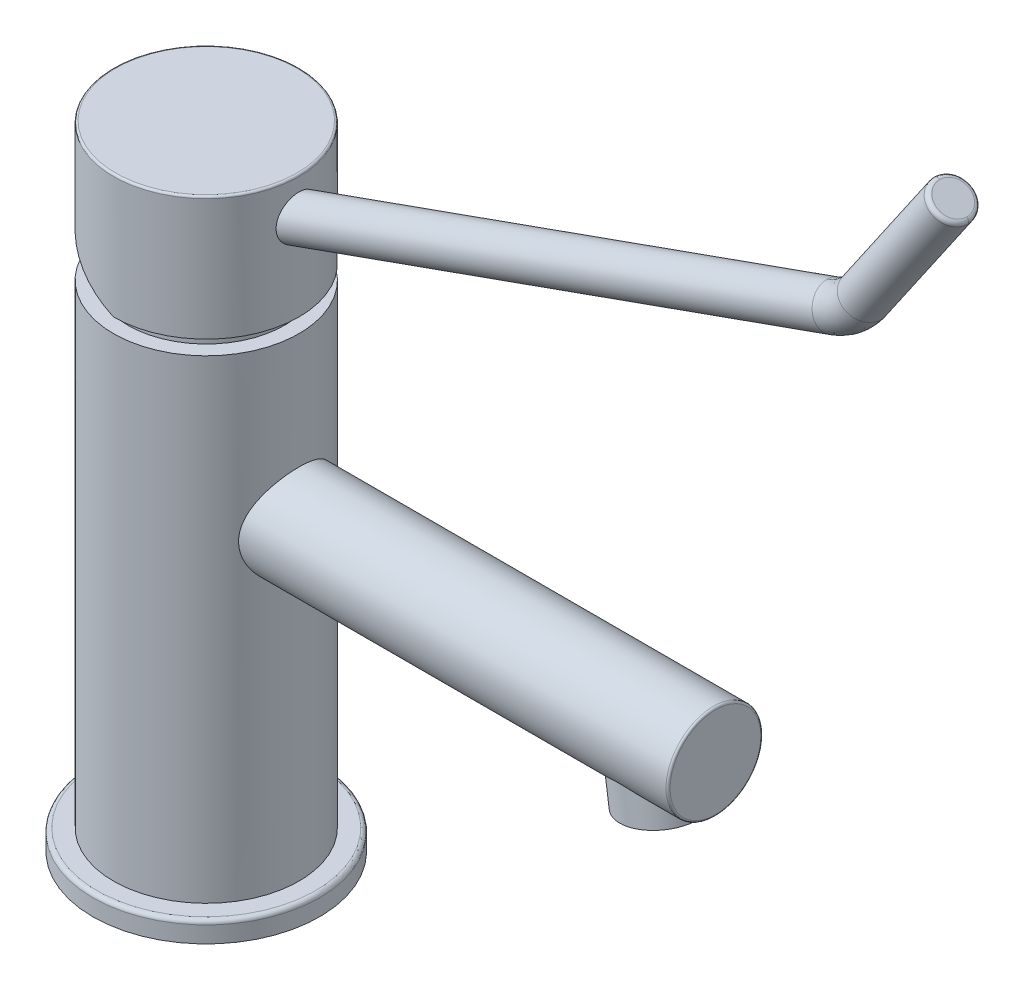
ISO-10303-21;
HEADER;
FILE_DESCRIPTION(('STEP AP214'),'2;1');
FILE_NAME('part.step','',(''),(''),'','','');
FILE_SCHEMA(('AUTOMOTIVE_DESIGN { 1 0 10303 214 1 1 1 1 }'));
ENDSEC;
DATA;
#1=APPLICATION_CONTEXT('core data for automotive mechanical design processes');
#2=APPLICATION_PROTOCOL_DEFINITION('international standard','automotive_design',2000,#1);
#3=PRODUCT_CONTEXT('',#1,'mechanical');
#4=PRODUCT('Part','Part','',(#3));
#5=PRODUCT_RELATED_PRODUCT_CATEGORY('part','',(#4));
#6=PRODUCT_DEFINITION_FORMATION('','',#4);
#7=PRODUCT_DEFINITION_CONTEXT('part definition',#1,'design');
#8=PRODUCT_DEFINITION('design','',#6,#7);
#9=PRODUCT_DEFINITION_SHAPE('','',#8);
#10=(LENGTH_UNIT() NAMED_UNIT(*) SI_UNIT(.MILLI.,.METRE.));
#11=(NAMED_UNIT(*) PLANE_ANGLE_UNIT() SI_UNIT($,.RADIAN.));
#12=(NAMED_UNIT(*) SI_UNIT($,.STERADIAN.) SOLID_ANGLE_UNIT());
#13=UNCERTAINTY_MEASURE_WITH_UNIT(LENGTH_MEASURE(1.E-05),#10,'distance_accuracy_value','');
#14=(GEOMETRIC_REPRESENTATION_CONTEXT(3) GLOBAL_UNCERTAINTY_ASSIGNED_CONTEXT((#13)) GLOBAL_UNIT_ASSIGNED_CONTEXT((#10,
#11,#12)) REPRESENTATION_CONTEXT('',''));
#15=CARTESIAN_POINT('',(0.,0.,0.));
#16=DIRECTION('',(0.,0.,1.));
#17=DIRECTION('',(1.,0.,0.));
#18=AXIS2_PLACEMENT_3D('',#15,#16,#17);
#19=CARTESIAN_POINT('',(-16.192,10.,16.192));
#20=DIRECTION('',(0.,-1.,0.));
#21=DIRECTION('',(0.,0.,-1.));
#22=AXIS2_PLACEMENT_3D('',#19,#20,#21);
#23=PLANE('',#22);
#24=CARTESIAN_POINT('',(0.,10.,0.));
#25=DIRECTION('',(0.,-1.,0.));
#26=DIRECTION('',(1.,0.,0.));
#27=AXIS2_PLACEMENT_3D('',#24,#25,#26);
#28=CIRCLE('',#27,16.);
#29=CARTESIAN_POINT('',(16.,10.,0.));
#30=VERTEX_POINT('',#29);
#31=EDGE_CURVE('E296',#30,#30,#28,.F.);
#32=ORIENTED_EDGE('',*,*,#31,.F.);
#33=EDGE_LOOP('',(#32));
#34=FACE_BOUND('',#33,.T.);
#35=ADVANCED_FACE('F31',(#34),#23,.T.);
#36=CARTESIAN_POINT('',(0.,10.,0.));
#37=DIRECTION('',(0.,-1.,0.));
#38=DIRECTION('',(1.,0.,0.));
#39=AXIS2_PLACEMENT_3D('',#36,#37,#38);
#40=CYLINDRICAL_SURFACE('',#39,16.);
#41=ORIENTED_EDGE('',*,*,#31,.T.);
#42=EDGE_LOOP('',(#41));
#43=FACE_BOUND('',#42,.T.);
#44=CARTESIAN_POINT('',(0.,0.,0.));
#45=DIRECTION('',(0.,-1.,0.));
#46=DIRECTION('',(1.,0.,0.));
#47=AXIS2_PLACEMENT_3D('',#44,#45,#46);
#48=CIRCLE('',#47,16.);
#49=CARTESIAN_POINT('',(16.,0.,0.));
#50=VERTEX_POINT('',#49);
#51=EDGE_CURVE('E397',#50,#50,#48,.T.);
#52=ORIENTED_EDGE('',*,*,#51,.T.);
#53=EDGE_LOOP('',(#52));
#54=FACE_BOUND('',#53,.T.);
#55=ADVANCED_FACE('F356',(#43,#54),#40,.F.);
#56=CARTESIAN_POINT('',(101.391803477,63.984972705,-9.212160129));
#57=DIRECTION('',(0.137568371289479,-0.990492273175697,0.));
#58=DIRECTION('',(0.990492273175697,0.137568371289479,0.));
#59=AXIS2_PLACEMENT_3D('',#56,#57,#58);
#60=PLANE('',#59);
#61=CARTESIAN_POINT('',(110.516376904,65.2522745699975,0.));
#62=DIRECTION('',(0.137568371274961,-0.990492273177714,0.));
#63=DIRECTION('',(0.990492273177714,0.137568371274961,0.));
#64=AXIS2_PLACEMENT_3D('',#61,#62,#63);
#65=CIRCLE('',#64,9.1029250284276);
#66=CARTESIAN_POINT('',(119.532753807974,66.5045491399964,0.));
#67=VERTEX_POINT('',#66);
#68=EDGE_CURVE('E393',#67,#67,#65,.T.);
#69=ORIENTED_EDGE('',*,*,#68,.T.);
#70=EDGE_LOOP('',(#69));
#71=FACE_BOUND('',#70,.T.);
#72=ADVANCED_FACE('F359',(#71),#60,.T.);
#73=CARTESIAN_POINT('',(-27.83,0.,-27.83));
#74=DIRECTION('',(0.,1.,0.));
#75=DIRECTION('',(0.,0.,1.));
#76=AXIS2_PLACEMENT_3D('',#73,#74,#75);
#77=PLANE('',#76);
#78=ORIENTED_EDGE('',*,*,#51,.F.);
#79=EDGE_LOOP('',(#78));
#80=FACE_BOUND('',#79,.T.);
#81=CARTESIAN_POINT('',(0.,0.,0.));
#82=DIRECTION('',(0.,1.,0.));
#83=DIRECTION('',(0.,0.,1.));
#84=AXIS2_PLACEMENT_3D('',#81,#82,#83);
#85=CIRCLE('',#84,27.5);
#86=CARTESIAN_POINT('',(0.,0.,27.5));
#87=VERTEX_POINT('',#86);
#88=EDGE_CURVE('E391',#87,#87,#85,.F.);
#89=ORIENTED_EDGE('',*,*,#88,.T.);
#90=EDGE_LOOP('',(#89));
#91=FACE_BOUND('',#90,.T.);
#92=ADVANCED_FACE('F354',(#80,#91),#77,.F.);
#93=CARTESIAN_POINT('',(109.358307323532,73.5903755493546,0.));
#94=DIRECTION('',(0.137568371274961,-0.990492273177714,0.));
#95=DIRECTION('',(0.990492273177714,0.137568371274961,0.));
#96=AXIS2_PLACEMENT_3D('',#93,#94,#95);
#97=CYLINDRICAL_SURFACE('',#96,9.1029250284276);
#98=ORIENTED_EDGE('',*,*,#68,.F.);
#99=EDGE_LOOP('',(#98));
#100=FACE_BOUND('',#99,.T.);
#101=CARTESIAN_POINT('',(119.186163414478,69.0000000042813,1.76957258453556E-09));
#102=CARTESIAN_POINT('',(119.186161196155,69.0000018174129,0.209765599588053));
#103=CARTESIAN_POINT('',(119.178028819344,69.0057538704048,0.419563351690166));
#104=CARTESIAN_POINT('',(119.145670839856,69.0286136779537,0.837308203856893));
#105=CARTESIAN_POINT('',(119.121441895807,69.0457237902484,1.04525491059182));
#106=CARTESIAN_POINT('',(119.057377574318,69.0908736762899,1.45770825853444));
#107=CARTESIAN_POINT('',(119.017528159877,69.1189232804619,1.66221163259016));
#108=CARTESIAN_POINT('',(118.923017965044,69.1852587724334,2.06603832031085));
#109=CARTESIAN_POINT('',(118.868357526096,69.2235444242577,2.26536175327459));
#110=CARTESIAN_POINT('',(118.745657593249,69.3091692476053,2.65612657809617));
#111=CARTESIAN_POINT('',(118.677721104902,69.3564386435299,2.84761573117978));
#112=CARTESIAN_POINT('',(118.529263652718,69.4592620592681,3.22336975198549));
#113=CARTESIAN_POINT('',(118.44873800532,69.5148191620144,3.40763189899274));
#114=CARTESIAN_POINT('',(118.189865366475,69.6924468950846,3.94848569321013));
#115=CARTESIAN_POINT('',(117.99415097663,69.8255245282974,4.29336725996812));
#116=CARTESIAN_POINT('',(117.626015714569,70.0718497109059,4.85482120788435));
#117=CARTESIAN_POINT('',(117.462835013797,70.179951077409,5.07996267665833));
#118=CARTESIAN_POINT('',(117.119316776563,70.404343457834,5.51243886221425));
#119=CARTESIAN_POINT('',(116.93897768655,70.5206352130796,5.71977196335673));
#120=CARTESIAN_POINT('',(116.562663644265,70.7590836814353,6.11705673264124));
#121=CARTESIAN_POINT('',(116.366652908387,70.8812535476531,6.30696636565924));
#122=CARTESIAN_POINT('',(115.960806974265,71.1286859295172,6.66907314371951));
#123=CARTESIAN_POINT('',(115.750973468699,71.2539480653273,6.84127245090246));
#124=CARTESIAN_POINT('',(115.31306940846,71.5081331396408,7.17223331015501));
#125=CARTESIAN_POINT('',(115.084675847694,71.6370698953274,7.3305563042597));
#126=CARTESIAN_POINT('',(114.614894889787,71.8925640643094,7.62893267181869));
#127=CARTESIAN_POINT('',(114.373504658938,72.0191209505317,7.76898203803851));
#128=CARTESIAN_POINT('',(113.878339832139,72.2661665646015,8.03033398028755));
#129=CARTESIAN_POINT('',(113.62458414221,72.3866640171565,8.15166406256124));
#130=CARTESIAN_POINT('',(113.104351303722,72.6175108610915,8.37508936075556));
#131=CARTESIAN_POINT('',(112.8378809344,72.7278655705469,8.47719468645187));
#132=CARTESIAN_POINT('',(112.394378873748,72.8946048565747,8.62643668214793));
#133=CARTESIAN_POINT('',(112.221220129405,72.9557252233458,8.67983975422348));
#134=CARTESIAN_POINT('',(111.869929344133,73.0702998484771,8.77811186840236));
#135=CARTESIAN_POINT('',(111.691796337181,73.1237526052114,8.82297923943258));
#136=CARTESIAN_POINT('',(111.331194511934,73.2211057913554,8.90346497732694));
#137=CARTESIAN_POINT('',(111.148733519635,73.2650221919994,8.93909882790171));
#138=CARTESIAN_POINT('',(110.779872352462,73.341498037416,9.00045914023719));
#139=CARTESIAN_POINT('',(110.593474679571,73.3740644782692,9.02619170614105));
#140=CARTESIAN_POINT('',(110.245540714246,73.4222016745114,9.06397051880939));
#141=CARTESIAN_POINT('',(110.084413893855,73.4395759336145,9.07747991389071));
#142=CARTESIAN_POINT('',(109.760948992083,73.4638593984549,9.09631618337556));
#143=CARTESIAN_POINT('',(109.598611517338,73.4707735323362,9.10164691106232));
#144=CARTESIAN_POINT('',(109.273871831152,73.473555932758,9.10379529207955));
#145=CARTESIAN_POINT('',(109.111469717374,73.4694308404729,9.10061806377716));
#146=CARTESIAN_POINT('',(108.787733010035,73.450013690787,9.08558433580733));
#147=CARTESIAN_POINT('',(108.626398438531,73.4347214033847,9.07372765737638));
#148=CARTESIAN_POINT('',(108.306265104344,73.3933668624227,9.04137426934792));
#149=CARTESIAN_POINT('',(108.147462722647,73.3673217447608,9.02089130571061));
#150=CARTESIAN_POINT('',(107.833172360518,73.3052667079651,8.97147591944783));
#151=CARTESIAN_POINT('',(107.677684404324,73.2692567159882,8.94254343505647));
#152=CARTESIAN_POINT('',(107.370583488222,73.1883234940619,8.87649207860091));
#153=CARTESIAN_POINT('',(107.21897666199,73.1433870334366,8.83936104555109));
#154=CARTESIAN_POINT('',(106.920374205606,73.0459000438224,8.75730860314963));
#155=CARTESIAN_POINT('',(106.773379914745,72.9933473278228,8.71238495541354));
#156=CARTESIAN_POINT('',(106.416002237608,72.8555996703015,8.59214617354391));
#157=CARTESIAN_POINT('',(106.208487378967,72.7667145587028,8.51250094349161));
#158=CARTESIAN_POINT('',(105.804438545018,72.5791537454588,8.33826048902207));
#159=CARTESIAN_POINT('',(105.607909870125,72.480473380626,8.24365813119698));
#160=CARTESIAN_POINT('',(105.225490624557,72.2765544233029,8.04025584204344));
#161=CARTESIAN_POINT('',(105.0396166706,72.1713060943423,7.93143455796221));
#162=CARTESIAN_POINT('',(104.678644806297,71.9572368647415,7.70038994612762));
#163=CARTESIAN_POINT('',(104.503545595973,71.848416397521,7.57816824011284));
#164=CARTESIAN_POINT('',(104.157303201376,71.6253006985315,7.31577183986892));
#165=CARTESIAN_POINT('',(103.986581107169,71.510957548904,7.17508264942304));
#166=CARTESIAN_POINT('',(103.656548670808,71.2832726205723,6.88016351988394));
#167=CARTESIAN_POINT('',(103.497238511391,71.1699308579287,6.72593336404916));
#168=CARTESIAN_POINT('',(103.190233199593,70.9463002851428,6.40430935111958));
#169=CARTESIAN_POINT('',(103.042536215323,70.8360109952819,6.23691757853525));
#170=CARTESIAN_POINT('',(102.759047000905,70.6202829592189,5.88923407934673));
#171=CARTESIAN_POINT('',(102.623260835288,70.5148466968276,5.70893586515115));
#172=CARTESIAN_POINT('',(102.341613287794,70.2928062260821,5.3033522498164));
#173=CARTESIAN_POINT('',(102.1981312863,70.1774656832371,5.07570804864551));
#174=CARTESIAN_POINT('',(101.929779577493,69.9587957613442,4.60439595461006));
#175=CARTESIAN_POINT('',(101.804900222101,69.8554601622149,4.36073646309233));
#176=CARTESIAN_POINT('',(101.575219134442,69.6634419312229,3.8589005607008));
#177=CARTESIAN_POINT('',(101.470398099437,69.5747452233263,3.60073841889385));
#178=CARTESIAN_POINT('',(101.282270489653,69.414363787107,3.07164330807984));
#179=CARTESIAN_POINT('',(101.198955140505,69.3426721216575,2.80071560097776));
#180=CARTESIAN_POINT('',(101.074368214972,69.2349205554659,2.32190538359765));
#181=CARTESIAN_POINT('',(101.027806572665,69.1944535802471,2.11636866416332));
#182=CARTESIAN_POINT('',(100.947584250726,69.1245418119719,1.70096417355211));
#183=CARTESIAN_POINT('',(100.913920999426,69.095094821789,1.49109727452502));
#184=CARTESIAN_POINT('',(100.85990606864,69.0477697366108,1.0684650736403));
#185=CARTESIAN_POINT('',(100.83954807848,69.0298861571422,0.85570119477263));
#186=CARTESIAN_POINT('',(100.812372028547,69.0060005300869,0.428627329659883));
#187=CARTESIAN_POINT('',(100.805555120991,68.9999994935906,0.214317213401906));
#188=CARTESIAN_POINT('',(100.805556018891,69.0000005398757,-0.228480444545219));
#189=CARTESIAN_POINT('',(100.813304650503,69.0068220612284,-0.456968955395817));
#190=CARTESIAN_POINT('',(100.84418636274,69.033960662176,-0.912097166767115));
#191=CARTESIAN_POINT('',(100.867320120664,69.0542783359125,-1.13873678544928));
#192=CARTESIAN_POINT('',(100.92865525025,69.1079857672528,-1.58849975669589));
#193=CARTESIAN_POINT('',(100.966863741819,69.1413817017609,-1.81162139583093));
#194=CARTESIAN_POINT('',(101.057833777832,69.2205550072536,-2.25262397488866));
#195=CARTESIAN_POINT('',(101.110595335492,69.2663323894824,-2.47050491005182));
#196=CARTESIAN_POINT('',(101.229753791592,69.3691380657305,-2.89864950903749));
#197=CARTESIAN_POINT('',(101.296087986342,69.4261145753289,-3.10894314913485));
#198=CARTESIAN_POINT('',(101.441822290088,69.5504099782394,-3.52178299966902));
#199=CARTESIAN_POINT('',(101.521222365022,69.6177288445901,-3.72432923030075));
#200=CARTESIAN_POINT('',(101.692325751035,69.7615420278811,-4.12067376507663));
#201=CARTESIAN_POINT('',(101.784024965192,69.8380332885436,-4.31447495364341));
#202=CARTESIAN_POINT('',(101.9790736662,69.999024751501,-4.69273813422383));
#203=CARTESIAN_POINT('',(102.082427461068,70.0835279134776,-4.87719663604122));
#204=CARTESIAN_POINT('',(102.308885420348,70.2663388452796,-5.25059952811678));
#205=CARTESIAN_POINT('',(102.432909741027,70.365210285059,-5.43870961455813));
#206=CARTESIAN_POINT('',(102.693105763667,70.5691702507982,-5.80277229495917));
#207=CARTESIAN_POINT('',(102.829278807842,70.6742594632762,-5.9787235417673));
#208=CARTESIAN_POINT('',(103.113534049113,70.8891547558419,-6.31839536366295));
#209=CARTESIAN_POINT('',(103.261640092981,70.9989700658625,-6.48209012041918));
#210=CARTESIAN_POINT('',(103.569137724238,71.2212518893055,-6.7964616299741));
#211=CARTESIAN_POINT('',(103.728526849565,71.333717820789,-6.947141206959));
#212=CARTESIAN_POINT('',(104.08566141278,71.5779171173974,-7.25891198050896));
#213=CARTESIAN_POINT('',(104.285401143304,71.7097738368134,-7.41763231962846));
#214=CARTESIAN_POINT('',(104.700200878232,71.9708303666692,-7.71638662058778));
#215=CARTESIAN_POINT('',(104.915266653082,72.1000291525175,-7.85641348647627));
#216=CARTESIAN_POINT('',(105.360446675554,72.351023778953,-8.11644947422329));
#217=CARTESIAN_POINT('',(105.590523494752,72.4728366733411,-8.23650592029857));
#218=CARTESIAN_POINT('',(106.066390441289,72.7039309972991,-8.45556760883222));
#219=CARTESIAN_POINT('',(106.312166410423,72.8132234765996,-8.55459148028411));
#220=CARTESIAN_POINT('',(106.716180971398,72.9722819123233,-8.69423482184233));
#221=CARTESIAN_POINT('',(106.869471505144,73.0282066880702,-8.74224858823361));
#222=CARTESIAN_POINT('',(107.181149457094,73.1318433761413,-8.82977138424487));
#223=CARTESIAN_POINT('',(107.339534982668,73.1795582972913,-8.8692835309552));
#224=CARTESIAN_POINT('',(107.660523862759,73.2652343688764,-8.93930819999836));
#225=CARTESIAN_POINT('',(107.823117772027,73.3032155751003,-8.9698392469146));
#226=CARTESIAN_POINT('',(108.151943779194,73.3682712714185,-9.0216507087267));
#227=CARTESIAN_POINT('',(108.318175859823,73.3953458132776,-9.04293116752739));
#228=CARTESIAN_POINT('',(108.654019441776,73.4377924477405,-9.07612036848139));
#229=CARTESIAN_POINT('',(108.823644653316,73.4530981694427,-9.08797597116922));
#230=CARTESIAN_POINT('',(109.163947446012,73.4713698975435,-9.10211476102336));
#231=CARTESIAN_POINT('',(109.334625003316,73.4743361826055,-9.10439816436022));
#232=CARTESIAN_POINT('',(109.675770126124,73.4681499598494,-9.09962073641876));
#233=CARTESIAN_POINT('',(109.846237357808,73.458986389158,-9.0925513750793));
#234=CARTESIAN_POINT('',(110.185637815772,73.4292816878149,-9.06947004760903));
#235=CARTESIAN_POINT('',(110.354570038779,73.4087335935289,-9.05345260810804));
#236=CARTESIAN_POINT('',(110.734962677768,73.350476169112,-9.00755438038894));
#237=CARTESIAN_POINT('',(110.945633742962,73.309636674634,-8.97510281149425));
#238=CARTESIAN_POINT('',(111.36151850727,73.2141639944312,-8.89777196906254));
#239=CARTESIAN_POINT('',(111.566729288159,73.1595235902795,-8.8528861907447));
#240=CARTESIAN_POINT('',(111.971498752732,73.0390347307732,-8.75158267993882));
#241=CARTESIAN_POINT('',(112.17104088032,72.9731567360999,-8.69513447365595));
#242=CARTESIAN_POINT('',(112.563640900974,72.8327739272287,-8.57160398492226));
#243=CARTESIAN_POINT('',(112.75669858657,72.7582688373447,-8.50452136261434));
#244=CARTESIAN_POINT('',(113.236837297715,72.5616020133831,-8.32214372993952));
#245=CARTESIAN_POINT('',(113.519597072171,72.4350891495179,-8.20012388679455));
#246=CARTESIAN_POINT('',(114.070149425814,72.1730283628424,-7.93388332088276));
#247=CARTESIAN_POINT('',(114.337933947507,72.0374756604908,-7.78965080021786));
#248=CARTESIAN_POINT('',(114.858432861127,71.7621250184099,-7.47947698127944));
#249=CARTESIAN_POINT('',(115.111142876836,71.6223258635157,-7.31352942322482));
#250=CARTESIAN_POINT('',(115.600751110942,71.3425549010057,-6.96002914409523));
#251=CARTESIAN_POINT('',(115.8376546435,71.2025831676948,-6.77248374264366));
#252=CARTESIAN_POINT('',(116.259392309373,70.947264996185,-6.40602722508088));
#253=CARTESIAN_POINT('',(116.446633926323,70.8314394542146,-6.23021728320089));
#254=CARTESIAN_POINT('',(116.807871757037,70.6042817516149,-5.86271434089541));
#255=CARTESIAN_POINT('',(116.98186747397,70.4929497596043,-5.67102074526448));
#256=CARTESIAN_POINT('',(117.314802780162,70.2771208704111,-5.27201164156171));
#257=CARTESIAN_POINT('',(117.473768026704,70.1726124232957,-5.06472388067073));
#258=CARTESIAN_POINT('',(117.77506967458,69.9724738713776,-4.63437784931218));
#259=CARTESIAN_POINT('',(117.917411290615,69.876840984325,-4.41132455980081));
#260=CARTESIAN_POINT('',(118.151298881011,69.7184325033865,-4.0053975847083));
#261=CARTESIAN_POINT('',(118.246833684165,69.6532820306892,-3.82574104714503));
#262=CARTESIAN_POINT('',(118.425918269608,69.5305331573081,-3.45808214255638));
#263=CARTESIAN_POINT('',(118.509470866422,69.4729329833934,-3.27008174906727));
#264=CARTESIAN_POINT('',(118.66337315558,69.3664065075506,-2.88663213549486));
#265=CARTESIAN_POINT('',(118.73373841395,69.3174699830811,-2.69119202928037));
#266=CARTESIAN_POINT('',(118.860251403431,69.229215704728,-2.2936526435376));
#267=CARTESIAN_POINT('',(118.916402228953,69.1898958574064,-2.09155482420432));
#268=CARTESIAN_POINT('',(119.001218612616,69.1303749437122,-1.73370495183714));
#269=CARTESIAN_POINT('',(119.033244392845,69.1078531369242,-1.57912536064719));
#270=CARTESIAN_POINT('',(119.088426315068,69.0690009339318,-1.26762891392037));
#271=CARTESIAN_POINT('',(119.111583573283,69.0526697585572,-1.11071235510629));
#272=CARTESIAN_POINT('',(119.148756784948,69.0264357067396,-0.795224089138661));
#273=CARTESIAN_POINT('',(119.162770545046,69.0165343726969,-0.636651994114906));
#274=CARTESIAN_POINT('',(119.181473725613,69.0033165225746,-0.31872600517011));
#275=CARTESIAN_POINT('',(119.18616509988,68.9999986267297,-0.159372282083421));
#276=CARTESIAN_POINT('',(119.186163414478,69.0000000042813,1.76957258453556E-09));
#277=B_SPLINE_CURVE_WITH_KNOTS('',3,(#101,#102,#103,#104,#105,#106,#107,#108,#109,#110,#111,
#112,#113,#114,#115,#116,#117,#118,#119,#120,#121,#122,#123,#124,#125,#126,#127,#128,#129,#130,
#131,#132,#133,#134,#135,#136,#137,#138,#139,#140,#141,#142,#143,#144,#145,#146,#147,#148,#149,
#150,#151,#152,#153,#154,#155,#156,#157,#158,#159,#160,#161,#162,#163,#164,#165,#166,#167,#168,
#169,#170,#171,#172,#173,#174,#175,#176,#177,#178,#179,#180,#181,#182,#183,#184,#185,#186,#187,
#188,#189,#190,#191,#192,#193,#194,#195,#196,#197,#198,#199,#200,#201,#202,#203,#204,#205,#206,
#207,#208,#209,#210,#211,#212,#213,#214,#215,#216,#217,#218,#219,#220,#221,#222,#223,#224,#225,
#226,#227,#228,#229,#230,#231,#232,#233,#234,#235,#236,#237,#238,#239,#240,#241,#242,#243,#244,
#245,#246,#247,#248,#249,#250,#251,#252,#253,#254,#255,#256,#257,#258,#259,#260,#261,#262,#263,
#264,#265,#266,#267,#268,#269,#270,#271,#272,#273,#274,#275,#276),.UNSPECIFIED.,.T.,.F.,(4,2,2,
2,2,2,2,2,2,2,2,2,2,2,2,2,2,2,2,2,2,2,2,2,2,2,2,2,2,2,2,2,2,2,2,2,2,2,2,2,2,2,2,2,2,2,2,2,2,2,2,
2,2,2,2,2,2,2,2,2,2,2,2,2,2,2,2,2,2,2,2,2,2,2,2,2,2,2,2,2,2,2,2,2,2,2,2,4),(0.,
0.629118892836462,1.25836842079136,1.88818471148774,2.51798648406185,3.14308302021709,
3.768412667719,5.0183618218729,5.91233158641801,6.8063823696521,7.70253630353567,
8.59858070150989,9.51682221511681,10.4352647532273,11.3523446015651,12.2689408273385,
12.8423117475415,13.4157948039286,13.9883098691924,14.5604714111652,15.0478380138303,
15.5349749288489,16.0218188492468,16.5086727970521,16.9947538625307,17.4808384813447,
17.9676490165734,18.4545996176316,19.1716503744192,19.8890441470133,20.6075278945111,
21.3259247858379,22.0723586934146,22.8188045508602,23.5651324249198,24.3118381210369,
25.1888996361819,26.0655046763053,26.9412618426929,27.8166611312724,28.4597879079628,
29.1027863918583,29.7454796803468,30.3882276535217,31.0734518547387,31.7587062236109,
32.4442846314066,33.1298636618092,33.8123441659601,34.4948228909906,35.1770748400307,
35.8595798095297,36.5970286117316,37.3345589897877,38.0736016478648,38.8124835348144,
39.6730273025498,40.5338968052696,41.3926962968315,42.250731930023,42.7605927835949,
43.2702663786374,43.7788812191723,44.2874936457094,44.7989537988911,45.3104024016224,
45.8223177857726,46.3345466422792,46.984621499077,47.6350370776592,48.2871894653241,
48.9393626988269,49.9367374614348,50.9346438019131,51.9328384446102,52.9306957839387,
53.77522827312,54.6197924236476,55.4628878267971,56.3057180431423,56.9461130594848,
57.5863574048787,58.2258411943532,58.8651856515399,59.3432131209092,59.8211804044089,
60.2992623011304,60.7772439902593),.UNSPECIFIED.);
#278=CARTESIAN_POINT('',(119.186163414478,69.0000000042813,1.76957258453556E-09));
#279=VERTEX_POINT('',#278);
#280=EDGE_CURVE('E332',#279,#279,#277,.T.);
#281=ORIENTED_EDGE('',*,*,#280,.T.);
#282=EDGE_LOOP('',(#281));
#283=FACE_BOUND('',#282,.T.);
#284=ADVANCED_FACE('F350',(#100,#283),#97,.T.);
#285=CARTESIAN_POINT('',(123.5,68.862,11.638));
#286=DIRECTION('',(1.,0.,0.));
#287=DIRECTION('',(0.,0.,-1.));
#288=AXIS2_PLACEMENT_3D('',#285,#286,#287);
#289=PLANE('',#288);
#290=CARTESIAN_POINT('',(123.5,80.5,0.));
#291=DIRECTION('',(1.,0.,0.));
#292=DIRECTION('',(0.,0.,-1.));
#293=AXIS2_PLACEMENT_3D('',#290,#291,#292);
#294=CIRCLE('',#293,11.);
#295=CARTESIAN_POINT('',(123.5,80.5,-11.));
#296=VERTEX_POINT('',#295);
#297=EDGE_CURVE('E293',#296,#296,#294,.T.);
#298=ORIENTED_EDGE('',*,*,#297,.T.);
#299=EDGE_LOOP('',(#298));
#300=FACE_BOUND('',#299,.T.);
#301=ADVANCED_FACE('F349',(#300),#289,.T.);
#302=CARTESIAN_POINT('',(0.,0.,0.));
#303=DIRECTION('',(0.,1.,0.));
#304=DIRECTION('',(0.,0.,1.));
#305=AXIS2_PLACEMENT_3D('',#302,#303,#304);
#306=CYLINDRICAL_SURFACE('',#305,27.5);
#307=CARTESIAN_POINT('',(0.,4.,0.));
#308=DIRECTION('',(0.,-1.,0.));
#309=DIRECTION('',(0.,0.,-1.));
#310=AXIS2_PLACEMENT_3D('',#307,#308,#309);
#311=CIRCLE('',#310,27.5);
#312=CARTESIAN_POINT('',(0.,4.,-27.5));
#313=VERTEX_POINT('',#312);
#314=EDGE_CURVE('E40',#313,#313,#311,.T.);
#315=ORIENTED_EDGE('',*,*,#314,.T.);
#316=EDGE_LOOP('',(#315));
#317=FACE_BOUND('',#316,.T.);
#318=ORIENTED_EDGE('',*,*,#88,.F.);
#319=EDGE_LOOP('',(#318));
#320=FACE_BOUND('',#319,.T.);
#321=ADVANCED_FACE('F306',(#317,#320),#306,.T.);
#322=CARTESIAN_POINT('',(18.714114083,80.5,0.));
#323=DIRECTION('',(1.,0.,0.));
#324=DIRECTION('',(0.,1.,0.));
#325=AXIS2_PLACEMENT_3D('',#322,#323,#324);
#326=CYLINDRICAL_SURFACE('',#325,11.5);
#327=CARTESIAN_POINT('',(123.,80.5,0.));
#328=DIRECTION('',(1.,0.,0.));
#329=DIRECTION('',(0.,0.,-1.));
#330=AXIS2_PLACEMENT_3D('',#327,#328,#329);
#331=CIRCLE('',#330,11.5);
#332=CARTESIAN_POINT('',(123.,80.5,-11.5));
#333=VERTEX_POINT('',#332);
#334=EDGE_CURVE('E301',#333,#333,#331,.F.);
#335=ORIENTED_EDGE('',*,*,#334,.T.);
#336=EDGE_LOOP('',(#335));
#337=FACE_BOUND('',#336,.T.);
#338=CARTESIAN_POINT('',(19.3390796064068,80.499999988,-11.5000000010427));
#339=CARTESIAN_POINT('',(19.339082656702,80.7988458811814,-11.499997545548));
#340=CARTESIAN_POINT('',(19.3460316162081,81.0977374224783,-11.4883338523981));
#341=CARTESIAN_POINT('',(19.3735645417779,81.6931078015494,-11.4418400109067));
#342=CARTESIAN_POINT('',(19.3941513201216,81.9895861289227,-11.4070050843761));
#343=CARTESIAN_POINT('',(19.4482013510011,82.5780967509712,-11.3146066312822));
#344=CARTESIAN_POINT('',(19.4816779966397,82.8701240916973,-11.2570194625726));
#345=CARTESIAN_POINT('',(19.5602904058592,83.4473279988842,-11.119859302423));
#346=CARTESIAN_POINT('',(19.6054258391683,83.7325047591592,-11.0402869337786));
#347=CARTESIAN_POINT('',(19.7055640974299,84.2927306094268,-10.8605365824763));
#348=CARTESIAN_POINT('',(19.7605117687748,84.5678264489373,-10.7604733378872));
#349=CARTESIAN_POINT('',(19.8787625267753,85.1081211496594,-10.5404170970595));
#350=CARTESIAN_POINT('',(19.9420688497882,85.3733161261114,-10.4204163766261));
#351=CARTESIAN_POINT('',(20.1418356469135,86.1519870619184,-10.0320116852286));
#352=CARTESIAN_POINT('',(20.2882223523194,86.6489629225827,-9.73507086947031));
#353=CARTESIAN_POINT('',(20.6062691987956,87.6311357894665,-9.04367946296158));
#354=CARTESIAN_POINT('',(20.7790201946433,88.1116120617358,-8.64302392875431));
#355=CARTESIAN_POINT('',(21.0357767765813,88.7792531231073,-7.98758408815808));
#356=CARTESIAN_POINT('',(21.1210283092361,88.9930904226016,-7.75984300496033));
#357=CARTESIAN_POINT('',(21.2887326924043,89.4019614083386,-7.28715576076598));
#358=CARTESIAN_POINT('',(21.3711865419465,89.597001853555,-7.04221583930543));
#359=CARTESIAN_POINT('',(21.5370712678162,89.980369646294,-6.5180855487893));
#360=CARTESIAN_POINT('',(21.6201493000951,90.167216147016,-6.23769855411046));
#361=CARTESIAN_POINT('',(21.7785384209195,90.5164343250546,-5.65994424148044));
#362=CARTESIAN_POINT('',(21.8538490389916,90.678804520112,-5.36257589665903));
#363=CARTESIAN_POINT('',(21.9944967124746,90.9773670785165,-4.75288627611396));
#364=CARTESIAN_POINT('',(22.0598387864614,91.1135726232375,-4.44057262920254));
#365=CARTESIAN_POINT('',(22.1786267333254,91.3583120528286,-3.80310182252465));
#366=CARTESIAN_POINT('',(22.2320739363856,91.4668490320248,-3.47794610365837));
#367=CARTESIAN_POINT('',(22.3219528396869,91.6478822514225,-2.84180865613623));
#368=CARTESIAN_POINT('',(22.3593490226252,91.7224467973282,-2.53155121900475));
#369=CARTESIAN_POINT('',(22.4214492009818,91.845669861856,-1.90467583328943));
#370=CARTESIAN_POINT('',(22.4461537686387,91.8943295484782,-1.58805817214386));
#371=CARTESIAN_POINT('',(22.4821421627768,91.9650618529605,-0.951277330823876));
#372=CARTESIAN_POINT('',(22.4934331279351,91.9871486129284,-0.631116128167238));
#373=CARTESIAN_POINT('',(22.502281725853,92.0044662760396,0.0101130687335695));
#374=CARTESIAN_POINT('',(22.4998402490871,91.9996989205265,0.331181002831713));
#375=CARTESIAN_POINT('',(22.4821469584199,91.9650388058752,0.94226503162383));
#376=CARTESIAN_POINT('',(22.4680797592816,91.9374693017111,1.23245085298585));
#377=CARTESIAN_POINT('',(22.4290099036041,91.8605275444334,1.80915066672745));
#378=CARTESIAN_POINT('',(22.4040080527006,91.8111568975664,2.09566492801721));
#379=CARTESIAN_POINT('',(22.3436647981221,91.6911591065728,2.66309273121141));
#380=CARTESIAN_POINT('',(22.3083230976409,91.6205313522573,2.94400611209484));
#381=CARTESIAN_POINT('',(22.2281182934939,91.4587487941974,3.49846144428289));
#382=CARTESIAN_POINT('',(22.1832548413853,91.3675932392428,3.77200312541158));
#383=CARTESIAN_POINT('',(22.0843660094,91.1642960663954,4.31364818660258));
#384=CARTESIAN_POINT('',(22.0302286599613,91.0518959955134,4.58163393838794));
#385=CARTESIAN_POINT('',(21.914379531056,90.8078400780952,5.10709203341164));
#386=CARTESIAN_POINT('',(21.8526650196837,90.676177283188,5.36456053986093));
#387=CARTESIAN_POINT('',(21.7229884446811,90.39463672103,5.86764428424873));
#388=CARTESIAN_POINT('',(21.6550269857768,90.2447607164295,6.11326066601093));
#389=CARTESIAN_POINT('',(21.5142194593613,89.9277153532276,6.59170534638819));
#390=CARTESIAN_POINT('',(21.4413716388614,89.7605397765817,6.82452900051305));
#391=CARTESIAN_POINT('',(21.2850060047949,89.3927956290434,7.29840230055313));
#392=CARTESIAN_POINT('',(21.2011399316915,89.1905605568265,7.53804538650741));
#393=CARTESIAN_POINT('',(21.0313119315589,88.7676230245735,7.99965102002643));
#394=CARTESIAN_POINT('',(20.9453498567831,88.5469192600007,8.22161231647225));
#395=CARTESIAN_POINT('',(20.7733386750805,88.0879447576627,8.64702803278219));
#396=CARTESIAN_POINT('',(20.6872895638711,87.8496573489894,8.8504644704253));
#397=CARTESIAN_POINT('',(20.5173632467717,87.3567993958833,9.23755882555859));
#398=CARTESIAN_POINT('',(20.4334860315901,87.1022289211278,9.4212168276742));
#399=CARTESIAN_POINT('',(20.2644936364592,86.5597552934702,9.77968490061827));
#400=CARTESIAN_POINT('',(20.1796944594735,86.2707645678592,9.95300318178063));
#401=CARTESIAN_POINT('',(20.0179595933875,85.6769014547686,10.274419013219));
#402=CARTESIAN_POINT('',(19.9410249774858,85.3720269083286,10.4225131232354));
#403=CARTESIAN_POINT('',(19.7979981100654,84.7488259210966,10.6917011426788));
#404=CARTESIAN_POINT('',(19.731885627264,84.4305260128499,10.8128455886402));
#405=CARTESIAN_POINT('',(19.6130471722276,83.7822222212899,11.0269406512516));
#406=CARTESIAN_POINT('',(19.5603153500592,83.4522235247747,11.1199035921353));
#407=CARTESIAN_POINT('',(19.4868538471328,82.9046184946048,11.2479236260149));
#408=CARTESIAN_POINT('',(19.4614532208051,82.6896448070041,11.291754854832));
#409=CARTESIAN_POINT('',(19.4175254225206,82.2568701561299,11.3671290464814));
#410=CARTESIAN_POINT('',(19.3989972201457,82.0390696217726,11.3986738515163));
#411=CARTESIAN_POINT('',(19.3691955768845,81.6015312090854,11.4492413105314));
#412=CARTESIAN_POINT('',(19.3579219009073,81.3817933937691,11.4682643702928));
#413=CARTESIAN_POINT('',(19.3428634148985,80.9413785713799,11.4936435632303));
#414=CARTESIAN_POINT('',(19.3390773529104,80.7207017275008,11.50000181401));
#415=CARTESIAN_POINT('',(19.3390826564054,80.2011540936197,11.4999975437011));
#416=CARTESIAN_POINT('',(19.3460316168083,79.9022625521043,11.4883338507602));
#417=CARTESIAN_POINT('',(19.3735645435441,79.3068921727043,11.4418400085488));
#418=CARTESIAN_POINT('',(19.3941513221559,79.0104138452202,11.4070050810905));
#419=CARTESIAN_POINT('',(19.4482013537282,78.421903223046,11.3146066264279));
#420=CARTESIAN_POINT('',(19.4816779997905,78.1298758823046,11.2570194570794));
#421=CARTESIAN_POINT('',(19.560290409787,77.552671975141,11.1198592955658));
#422=CARTESIAN_POINT('',(19.6054258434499,77.2674952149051,11.0402869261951));
#423=CARTESIAN_POINT('',(19.7055641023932,76.7072693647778,10.8605365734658));
#424=CARTESIAN_POINT('',(19.7605117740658,76.4321735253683,10.7604733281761));
#425=CARTESIAN_POINT('',(19.8787625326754,75.8918788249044,10.5404170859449));
#426=CARTESIAN_POINT('',(19.9420688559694,75.6266838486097,10.4204163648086));
#427=CARTESIAN_POINT('',(20.1418356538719,74.8480129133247,10.0320116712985));
#428=CARTESIAN_POINT('',(20.288222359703,74.3510370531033,9.73507085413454));
#429=CARTESIAN_POINT('',(20.6062692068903,73.3688641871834,9.04367944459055));
#430=CARTESIAN_POINT('',(20.7790202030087,72.8883879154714,8.64302390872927));
#431=CARTESIAN_POINT('',(21.0357767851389,72.2207468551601,7.98758406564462));
#432=CARTESIAN_POINT('',(21.1210283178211,72.0069095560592,7.75984298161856));
#433=CARTESIAN_POINT('',(21.28873270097,71.5980385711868,7.28715573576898));
#434=CARTESIAN_POINT('',(21.3711865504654,71.4029981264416,7.04221581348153));
#435=CARTESIAN_POINT('',(21.5370712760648,71.0196303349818,6.51808552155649));
#436=CARTESIAN_POINT('',(21.6201493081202,70.8327838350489,6.23769852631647));
#437=CARTESIAN_POINT('',(21.7785384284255,70.4835656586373,5.65994421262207));
#438=CARTESIAN_POINT('',(21.8538490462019,70.3211954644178,5.3625758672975));
#439=CARTESIAN_POINT('',(21.9944967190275,70.0226329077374,4.75288624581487));
#440=CARTESIAN_POINT('',(22.0598387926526,69.8864273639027,4.440572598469));
#441=CARTESIAN_POINT('',(22.1786267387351,69.6416879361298,3.80310179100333));
#442=CARTESIAN_POINT('',(22.2320739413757,69.5331509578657,3.47794607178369));
#443=CARTESIAN_POINT('',(22.3219528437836,69.3521177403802,2.84180862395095));
#444=CARTESIAN_POINT('',(22.3593490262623,69.2775531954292,2.53155118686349));
#445=CARTESIAN_POINT('',(22.4214492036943,69.1543301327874,1.90467580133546));
#446=CARTESIAN_POINT('',(22.4461537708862,69.1056704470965,1.58805814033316));
#447=CARTESIAN_POINT('',(22.4821421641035,69.03493814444,0.951277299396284));
#448=CARTESIAN_POINT('',(22.493433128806,69.0128513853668,0.631116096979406));
#449=CARTESIAN_POINT('',(22.5022817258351,68.9955337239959,-0.0101130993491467));
#450=CARTESIAN_POINT('',(22.4998402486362,69.0003010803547,-0.331181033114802));
#451=CARTESIAN_POINT('',(22.4821469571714,69.0349611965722,-0.942265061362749));
#452=CARTESIAN_POINT('',(22.4680797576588,69.0625307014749,-1.23245088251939));
#453=CARTESIAN_POINT('',(22.4290099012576,69.1394724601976,-1.80915069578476));
#454=CARTESIAN_POINT('',(22.4040080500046,69.1888431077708,-2.09566495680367));
#455=CARTESIAN_POINT('',(22.3436647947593,69.3088409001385,-2.66309275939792));
#456=CARTESIAN_POINT('',(22.3083230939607,69.3794686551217,-2.94400613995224));
#457=CARTESIAN_POINT('',(22.228118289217,69.541251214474,-3.4984614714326));
#458=CARTESIAN_POINT('',(22.1832548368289,69.6324067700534,-3.77200315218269));
#459=CARTESIAN_POINT('',(22.0843660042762,69.83570394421,-4.31364821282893));
#460=CARTESIAN_POINT('',(22.0302286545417,69.948104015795,-4.58163396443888));
#461=CARTESIAN_POINT('',(21.9143795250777,70.1921599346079,-5.10709205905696));
#462=CARTESIAN_POINT('',(21.8526650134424,70.3238227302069,-5.36456056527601));
#463=CARTESIAN_POINT('',(21.7229884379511,70.605363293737,-5.8676443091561));
#464=CARTESIAN_POINT('',(21.6550269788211,70.7552392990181,-6.11326069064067));
#465=CARTESIAN_POINT('',(21.5142194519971,71.072284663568,-6.5917053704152));
#466=CARTESIAN_POINT('',(21.4413716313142,71.2394602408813,-6.82452902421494));
#467=CARTESIAN_POINT('',(21.2850059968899,71.6072043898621,-7.29840232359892));
#468=CARTESIAN_POINT('',(21.2011399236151,71.8094394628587,-7.53804540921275));
#469=CARTESIAN_POINT('',(21.0313119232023,72.2323769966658,-7.99965104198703));
#470=CARTESIAN_POINT('',(20.9453498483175,72.4530807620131,-8.22161233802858));
#471=CARTESIAN_POINT('',(20.7733386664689,72.9120552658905,-8.64702805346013));
#472=CARTESIAN_POINT('',(20.6872895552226,73.1503426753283,-8.8504644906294));
#473=CARTESIAN_POINT('',(20.5173632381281,73.6432006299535,-9.2375588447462));
#474=CARTESIAN_POINT('',(20.4334860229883,73.8977711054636,-9.42121684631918));
#475=CARTESIAN_POINT('',(20.2644936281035,74.4402447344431,-9.77968491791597));
#476=CARTESIAN_POINT('',(20.1796944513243,74.7292354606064,-9.95300319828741));
#477=CARTESIAN_POINT('',(20.0179595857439,75.323098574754,-10.2744190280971));
#478=CARTESIAN_POINT('',(19.9410249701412,75.6279731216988,-10.4225131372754));
#479=CARTESIAN_POINT('',(19.79799810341,76.2511741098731,-10.6917011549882));
#480=CARTESIAN_POINT('',(19.7318856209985,76.5694740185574,-10.8128456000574));
#481=CARTESIAN_POINT('',(19.6130471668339,77.2177778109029,-11.0269406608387));
#482=CARTESIAN_POINT('',(19.560315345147,77.5477765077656,-11.1199036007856));
#483=CARTESIAN_POINT('',(19.4868538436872,78.0953815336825,-11.2479236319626));
#484=CARTESIAN_POINT('',(19.461453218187,78.3103552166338,-11.291754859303));
#485=CARTESIAN_POINT('',(19.4175254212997,78.743129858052,-11.3671290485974));
#486=CARTESIAN_POINT('',(19.3989972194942,78.9609303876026,-11.3986738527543));
#487=CARTESIAN_POINT('',(19.3691955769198,79.3984687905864,-11.4492413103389));
#488=CARTESIAN_POINT('',(19.3579219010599,79.6182066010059,-11.4682643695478));
#489=CARTESIAN_POINT('',(19.3428634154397,80.0586214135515,-11.4936435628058));
#490=CARTESIAN_POINT('',(19.3390773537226,80.2792982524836,-11.5000018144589));
#491=CARTESIAN_POINT('',(19.3390796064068,80.499999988,-11.5000000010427));
#492=B_SPLINE_CURVE_WITH_KNOTS('',3,(#338,#339,#340,#341,#342,#343,#344,#345,#346,#347,#348,
#349,#350,#351,#352,#353,#354,#355,#356,#357,#358,#359,#360,#361,#362,#363,#364,#365,#366,#367,
#368,#369,#370,#371,#372,#373,#374,#375,#376,#377,#378,#379,#380,#381,#382,#383,#384,#385,#386,
#387,#388,#389,#390,#391,#392,#393,#394,#395,#396,#397,#398,#399,#400,#401,#402,#403,#404,#405,
#406,#407,#408,#409,#410,#411,#412,#413,#414,#415,#416,#417,#418,#419,#420,#421,#422,#423,#424,
#425,#426,#427,#428,#429,#430,#431,#432,#433,#434,#435,#436,#437,#438,#439,#440,#441,#442,#443,
#444,#445,#446,#447,#448,#449,#450,#451,#452,#453,#454,#455,#456,#457,#458,#459,#460,#461,#462,
#463,#464,#465,#466,#467,#468,#469,#470,#471,#472,#473,#474,#475,#476,#477,#478,#479,#480,#481,
#482,#483,#484,#485,#486,#487,#488,#489,#490,#491),.UNSPECIFIED.,.T.,.F.,(4,2,2,2,2,2,2,2,2,2,2,
2,2,2,2,2,2,2,2,2,2,2,2,2,2,2,2,2,2,2,2,2,2,2,2,2,2,2,2,2,2,2,2,2,2,2,2,2,2,2,2,2,2,2,2,2,2,2,2,
2,2,2,2,2,2,2,2,2,2,2,2,2,2,2,2,2,4),(0.,0.896311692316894,1.79280827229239,2.69023887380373,
3.58764405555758,4.48015528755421,5.37301310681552,7.15741698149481,9.09586788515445,
10.0665028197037,11.0367874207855,12.076552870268,13.1163812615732,14.1556844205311,
15.1948712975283,16.1573849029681,17.1198551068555,18.0818128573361,19.0437082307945,
19.9181686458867,20.7925646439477,21.6669857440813,22.5414388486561,23.4273086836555,
24.3134988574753,25.1996033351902,26.0860274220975,27.0587660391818,28.0315734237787,
29.0053152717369,29.9790529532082,31.0201744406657,32.061437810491,33.100731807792,
34.1395706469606,34.801740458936,35.4638109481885,36.1258599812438,36.7877983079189,
37.6841100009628,38.5806065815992,39.4780371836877,40.3754423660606,41.2679535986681,
42.1608114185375,43.94521529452,45.8836662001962,46.8543011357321,47.8245857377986,
48.8643511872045,49.9041795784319,50.9434827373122,51.9826696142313,52.9451832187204,
53.9076534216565,54.8696111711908,55.8315065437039,56.7059669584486,57.5803629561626,
58.4547840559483,59.3292371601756,60.2151069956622,61.1012971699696,61.9874016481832,
62.8738257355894,63.8465643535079,64.8193717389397,65.7931135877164,66.7668512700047,
67.8079727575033,68.8492361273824,69.8885301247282,70.9273689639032,71.5895387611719,
72.2516092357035,72.9136582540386,73.5755965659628),.UNSPECIFIED.);
#493=CARTESIAN_POINT('',(19.3390796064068,80.499999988,-11.5000000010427));
#494=VERTEX_POINT('',#493);
#495=EDGE_CURVE('E327',#494,#494,#492,.T.);
#496=ORIENTED_EDGE('',*,*,#495,.T.);
#497=EDGE_LOOP('',(#496));
#498=FACE_BOUND('',#497,.T.);
#499=ORIENTED_EDGE('',*,*,#280,.F.);
#500=EDGE_LOOP('',(#499));
#501=FACE_BOUND('',#500,.T.);
#502=ADVANCED_FACE('F321',(#337,#498,#501),#326,.T.);
#503=CARTESIAN_POINT('',(-27.83,5.,27.83));
#504=DIRECTION('',(0.,-1.,0.));
#505=DIRECTION('',(0.,0.,-1.));
#506=AXIS2_PLACEMENT_3D('',#503,#504,#505);
#507=PLANE('',#506);
#508=CARTESIAN_POINT('',(0.,5.,0.));
#509=DIRECTION('',(0.,-1.,0.));
#510=DIRECTION('',(0.,0.,-1.));
#511=AXIS2_PLACEMENT_3D('',#508,#509,#510);
#512=CIRCLE('',#511,26.5);
#513=CARTESIAN_POINT('',(0.,5.,-26.5));
#514=VERTEX_POINT('',#513);
#515=EDGE_CURVE('E11',#514,#514,#512,.F.);
#516=ORIENTED_EDGE('',*,*,#515,.T.);
#517=EDGE_LOOP('',(#516));
#518=FACE_BOUND('',#517,.T.);
#519=CARTESIAN_POINT('',(0.,5.,0.));
#520=DIRECTION('',(0.,1.,0.));
#521=DIRECTION('',(-1.,0.,0.));
#522=AXIS2_PLACEMENT_3D('',#519,#520,#521);
#523=CIRCLE('',#522,22.5);
#524=CARTESIAN_POINT('',(-22.5,5.,0.));
#525=VERTEX_POINT('',#524);
#526=EDGE_CURVE('E325',#525,#525,#523,.F.);
#527=ORIENTED_EDGE('',*,*,#526,.T.);
#528=EDGE_LOOP('',(#527));
#529=FACE_BOUND('',#528,.T.);
#530=ADVANCED_FACE('F317',(#518,#529),#507,.F.);
#531=CARTESIAN_POINT('',(0.,5.,0.));
#532=DIRECTION('',(0.,1.,0.));
#533=DIRECTION('',(-1.,0.,0.));
#534=AXIS2_PLACEMENT_3D('',#531,#532,#533);
#535=CYLINDRICAL_SURFACE('',#534,22.5);
#536=CARTESIAN_POINT('',(0.,120.,0.));
#537=DIRECTION('',(0.,1.,0.));
#538=DIRECTION('',(-1.,0.,0.));
#539=AXIS2_PLACEMENT_3D('',#536,#537,#538);
#540=CIRCLE('',#539,22.5);
#541=CARTESIAN_POINT('',(-22.5,120.,0.));
#542=VERTEX_POINT('',#541);
#543=EDGE_CURVE('E90',#542,#542,#540,.F.);
#544=ORIENTED_EDGE('',*,*,#543,.T.);
#545=EDGE_LOOP('',(#544));
#546=FACE_BOUND('',#545,.T.);
#547=ORIENTED_EDGE('',*,*,#526,.F.);
#548=EDGE_LOOP('',(#547));
#549=FACE_BOUND('',#548,.T.);
#550=ORIENTED_EDGE('',*,*,#495,.F.);
#551=EDGE_LOOP('',(#550));
#552=FACE_BOUND('',#551,.T.);
#553=ADVANCED_FACE('F320',(#546,#549,#552),#535,.T.);
#554=CARTESIAN_POINT('',(-22.77,120.,22.77));
#555=DIRECTION('',(0.,-1.,0.));
#556=DIRECTION('',(0.,0.,-1.));
#557=AXIS2_PLACEMENT_3D('',#554,#555,#556);
#558=PLANE('',#557);
#559=CARTESIAN_POINT('',(0.,120.,0.));
#560=DIRECTION('',(0.,1.,0.));
#561=DIRECTION('',(0.,0.,1.));
#562=AXIS2_PLACEMENT_3D('',#559,#560,#561);
#563=CIRCLE('',#562,19.);
#564=CARTESIAN_POINT('',(0.,120.,19.));
#565=VERTEX_POINT('',#564);
#566=EDGE_CURVE('E89',#565,#565,#563,.F.);
#567=ORIENTED_EDGE('',*,*,#566,.T.);
#568=EDGE_LOOP('',(#567));
#569=FACE_BOUND('',#568,.T.);
#570=ORIENTED_EDGE('',*,*,#543,.F.);
#571=EDGE_LOOP('',(#570));
#572=FACE_BOUND('',#571,.T.);
#573=ADVANCED_FACE('F372',(#569,#572),#558,.F.);
#574=CARTESIAN_POINT('',(0.,123.5,-22.77));
#575=DIRECTION('',(0.406138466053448,0.913811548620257,0.));
#576=DIRECTION('',(-0.913811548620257,0.406138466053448,0.));
#577=AXIS2_PLACEMENT_3D('',#574,#575,#576);
#578=PLANE('',#577);
#579=DIRECTION('',(0.,0.,1.));
#580=VECTOR('',#579,1.);
#581=CARTESIAN_POINT('',(0.,123.5,0.));
#582=LINE('',#581,#580);
#583=CARTESIAN_POINT('',(1.31054267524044E-08,123.499999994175,18.6748493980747));
#584=VERTEX_POINT('',#583);
#585=CARTESIAN_POINT('',(0.,123.5,22.5));
#586=VERTEX_POINT('',#585);
#587=EDGE_CURVE('E85',#584,#586,#582,.T.);
#588=ORIENTED_EDGE('',*,*,#587,.T.);
#589=CARTESIAN_POINT('',(0.,123.5,0.));
#590=DIRECTION('',(0.406138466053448,0.913811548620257,0.));
#591=DIRECTION('',(-0.913811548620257,0.406138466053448,0.));
#592=AXIS2_PLACEMENT_3D('',#589,#590,#591);
#593=ELLIPSE('',#592,24.6221445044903,22.5);
#594=CARTESIAN_POINT('',(-4.61482714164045E-09,123.500000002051,-22.5));
#595=VERTEX_POINT('',#594);
#596=EDGE_CURVE('E102',#586,#595,#593,.F.);
#597=ORIENTED_EDGE('',*,*,#596,.T.);
#598=DIRECTION('',(0.,0.,1.));
#599=VECTOR('',#598,1.);
#600=CARTESIAN_POINT('',(0.,123.5,0.));
#601=LINE('',#600,#599);
#602=CARTESIAN_POINT('',(1.36623075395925E-08,123.499999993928,-18.6748493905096));
#603=VERTEX_POINT('',#602);
#604=EDGE_CURVE('E79',#595,#603,#601,.T.);
#605=ORIENTED_EDGE('',*,*,#604,.T.);
#606=CARTESIAN_POINT('',(2.73246188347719E-08,123.499999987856,-18.6748493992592));
#607=CARTESIAN_POINT('',(-0.319976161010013,123.642211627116,-18.6482075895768));
#608=CARTESIAN_POINT('',(-0.639264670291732,123.784117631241,-18.6116959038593));
#609=CARTESIAN_POINT('',(-1.27544751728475,124.066865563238,-18.5190991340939));
#610=CARTESIAN_POINT('',(-1.59234196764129,124.207707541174,-18.463014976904));
#611=CARTESIAN_POINT('',(-2.2227431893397,124.487885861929,-18.3314381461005));
#612=CARTESIAN_POINT('',(-2.53625001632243,124.627222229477,-18.2559457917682));
#613=CARTESIAN_POINT('',(-3.15868030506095,124.90385791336,-18.0858521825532));
#614=CARTESIAN_POINT('',(-3.46760669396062,125.041158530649,-17.991263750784));
#615=CARTESIAN_POINT('',(-4.08011648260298,125.313385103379,-17.783242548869));
#616=CARTESIAN_POINT('',(-4.38369993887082,125.448311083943,-17.6698099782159));
#617=CARTESIAN_POINT('',(-4.98454730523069,125.71535435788,-17.4244704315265));
#618=CARTESIAN_POINT('',(-5.28181125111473,125.847471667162,-17.2925635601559));
#619=CARTESIAN_POINT('',(-6.01610940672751,126.17382640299,-16.9401131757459));
#620=CARTESIAN_POINT('',(-6.44864891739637,126.366066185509,-16.7082456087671));
#621=CARTESIAN_POINT('',(-7.29440478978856,126.74195768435,-16.2054017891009));
#622=CARTESIAN_POINT('',(-7.70761859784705,126.92560826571,-15.9344203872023));
#623=CARTESIAN_POINT('',(-8.31056192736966,127.193583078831,-15.5002030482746));
#624=CARTESIAN_POINT('',(-8.50873196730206,127.281658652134,-15.3508381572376));
#625=CARTESIAN_POINT('',(-8.89908806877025,127.455150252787,-15.0431458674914));
#626=CARTESIAN_POINT('',(-9.09127580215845,127.540567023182,-14.8848210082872));
#627=CARTESIAN_POINT('',(-9.65846574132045,127.792651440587,-14.3967217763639));
#628=CARTESIAN_POINT('',(-10.0241299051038,127.955168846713,-14.0537973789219));
#629=CARTESIAN_POINT('',(-10.7276702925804,128.267853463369,-13.3355497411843));
#630=CARTESIAN_POINT('',(-11.0655502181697,128.418022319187,-12.9602308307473));
#631=CARTESIAN_POINT('',(-11.7112323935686,128.704992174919,-12.1797880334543));
#632=CARTESIAN_POINT('',(-12.0190344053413,128.841793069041,-11.7746639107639));
#633=CARTESIAN_POINT('',(-12.602555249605,129.101135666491,-10.9371971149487));
#634=CARTESIAN_POINT('',(-12.8782561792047,129.22366941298,-10.5048394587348));
#635=CARTESIAN_POINT('',(-13.2660263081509,129.396011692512,-9.83854211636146));
#636=CARTESIAN_POINT('',(-13.3909899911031,129.451551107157,-9.61347482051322));
#637=CARTESIAN_POINT('',(-13.6321692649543,129.558741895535,-9.15771650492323));
#638=CARTESIAN_POINT('',(-13.7483825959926,129.610392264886,-8.92702405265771));
#639=CARTESIAN_POINT('',(-14.0836319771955,129.759391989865,-8.22697833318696));
#640=CARTESIAN_POINT('',(-14.2891946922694,129.850753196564,-7.7497988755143));
#641=CARTESIAN_POINT('',(-14.6628068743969,130.016803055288,-6.77816773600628));
#642=CARTESIAN_POINT('',(-14.8308564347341,130.091491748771,-6.28371609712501));
#643=CARTESIAN_POINT('',(-15.0537736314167,130.190566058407,-5.53222789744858));
#644=CARTESIAN_POINT('',(-15.1231838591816,130.221415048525,-5.28026513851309));
#645=CARTESIAN_POINT('',(-15.252228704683,130.278768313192,-4.77343038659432));
#646=CARTESIAN_POINT('',(-15.3118657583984,130.305273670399,-4.51855913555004));
#647=CARTESIAN_POINT('',(-15.4759377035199,130.378194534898,-3.75031208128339));
#648=CARTESIAN_POINT('',(-15.5656078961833,130.418047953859,-3.23305165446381));
#649=CARTESIAN_POINT('',(-15.6952791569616,130.475679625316,-2.26369906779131));
#650=CARTESIAN_POINT('',(-15.7404094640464,130.495737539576,-1.81241053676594));
#651=CARTESIAN_POINT('',(-15.8006163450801,130.522496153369,-0.907431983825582));
#652=CARTESIAN_POINT('',(-15.815692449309,130.529196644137,-0.453741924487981));
#653=CARTESIAN_POINT('',(-15.8156866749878,130.529194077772,0.525966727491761));
#654=CARTESIAN_POINT('',(-15.7954223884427,130.520187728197,1.05200314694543));
#655=CARTESIAN_POINT('',(-15.7347573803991,130.4932255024,1.83818075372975));
#656=CARTESIAN_POINT('',(-15.7094808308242,130.481991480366,2.09982557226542));
#657=CARTESIAN_POINT('',(-15.6488744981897,130.455055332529,2.62178663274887));
#658=CARTESIAN_POINT('',(-15.613542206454,130.439352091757,2.88210252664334));
#659=CARTESIAN_POINT('',(-15.4924357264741,130.385526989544,3.66098922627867));
#660=CARTESIAN_POINT('',(-15.3916024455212,130.340712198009,4.17684491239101));
#661=CARTESIAN_POINT('',(-15.1505350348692,130.233571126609,5.19741259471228));
#662=CARTESIAN_POINT('',(-15.0103008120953,130.171244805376,5.70212456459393));
#663=CARTESIAN_POINT('',(-14.7712514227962,130.065000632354,6.44789159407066));
#664=CARTESIAN_POINT('',(-14.6868027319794,130.02746788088,6.69455454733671));
#665=CARTESIAN_POINT('',(-14.5085016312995,129.948222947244,7.18370107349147));
#666=CARTESIAN_POINT('',(-14.4146516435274,129.906511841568,7.42618570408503));
#667=CARTESIAN_POINT('',(-14.119181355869,129.77519171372,8.14687154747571));
#668=CARTESIAN_POINT('',(-13.903629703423,129.679390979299,8.6183391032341));
#669=CARTESIAN_POINT('',(-13.4371156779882,129.472051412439,9.5394662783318));
#670=CARTESIAN_POINT('',(-13.1861681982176,129.360519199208,9.98913496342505));
#671=CARTESIAN_POINT('',(-12.6505514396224,129.122467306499,10.8637575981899));
#672=CARTESIAN_POINT('',(-12.3658824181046,128.99594774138,11.2887117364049));
#673=CARTESIAN_POINT('',(-11.7648271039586,128.728812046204,12.1108982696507));
#674=CARTESIAN_POINT('',(-11.4484386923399,128.588194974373,12.5081288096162));
#675=CARTESIAN_POINT('',(-10.7862222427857,128.293876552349,13.2720091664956));
#676=CARTESIAN_POINT('',(-10.4403939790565,128.140175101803,13.6386587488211));
#677=CARTESIAN_POINT('',(-9.72158940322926,127.820706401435,14.338915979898));
#678=CARTESIAN_POINT('',(-9.34860535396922,127.654935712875,14.6725141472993));
#679=CARTESIAN_POINT('',(-8.77099496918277,127.398219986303,15.1461338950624));
#680=CARTESIAN_POINT('',(-8.57542874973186,127.311301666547,15.2995490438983));
#681=CARTESIAN_POINT('',(-8.17850979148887,127.134893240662,15.5972630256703));
#682=CARTESIAN_POINT('',(-7.97715557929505,127.045402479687,15.7415595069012));
#683=CARTESIAN_POINT('',(-7.3649091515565,126.773292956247,16.1603840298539));
#684=CARTESIAN_POINT('',(-6.94587039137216,126.587053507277,16.4208166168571));
#685=CARTESIAN_POINT('',(-6.08921978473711,126.206319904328,16.9020887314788));
#686=CARTESIAN_POINT('',(-5.65160798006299,126.011825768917,17.1229283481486));
#687=CARTESIAN_POINT('',(-4.98388530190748,125.715060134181,17.4232117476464));
#688=CARTESIAN_POINT('',(-4.75949543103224,125.615331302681,17.5181198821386));
#689=CARTESIAN_POINT('',(-4.30731998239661,125.414364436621,17.6974827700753));
#690=CARTESIAN_POINT('',(-4.07953526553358,125.313126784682,17.7819401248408));
#691=CARTESIAN_POINT('',(-3.39174021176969,125.00744009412,18.0193857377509));
#692=CARTESIAN_POINT('',(-2.92706601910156,124.800918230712,18.1565477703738));
#693=CARTESIAN_POINT('',(-2.05311472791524,124.412495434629,18.3717422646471));
#694=CARTESIAN_POINT('',(-1.64495643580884,124.231091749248,18.4552971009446));
#695=CARTESIAN_POINT('',(-0.824924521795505,123.866633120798,18.589628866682));
#696=CARTESIAN_POINT('',(-0.41305906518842,123.68358180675,18.6404654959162));
#697=CARTESIAN_POINT('',(2.62108529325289E-08,123.499999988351,18.6748493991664));
#698=B_SPLINE_CURVE_WITH_KNOTS('',3,(#606,#607,#608,#609,#610,#611,#612,#613,#614,#615,#616,
#617,#618,#619,#620,#621,#622,#623,#624,#625,#626,#627,#628,#629,#630,#631,#632,#633,#634,#635,
#636,#637,#638,#639,#640,#641,#642,#643,#644,#645,#646,#647,#648,#649,#650,#651,#652,#653,#654,
#655,#656,#657,#658,#659,#660,#661,#662,#663,#664,#665,#666,#667,#668,#669,#670,#671,#672,#673,
#674,#675,#676,#677,#678,#679,#680,#681,#682,#683,#684,#685,#686,#687,#688,#689,#690,#691,#692,
#693,#694,#695,#696,#697),.UNSPECIFIED.,.F.,.F.,(4,2,2,2,2,2,2,2,2,2,2,2,2,2,2,2,2,2,2,2,2,2,2,
2,2,2,2,2,2,2,2,2,2,2,2,2,2,2,2,2,2,2,2,2,2,4),(0.,1.05336179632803,2.10667371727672,
3.1599683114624,4.21255795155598,5.26513644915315,6.31770898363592,7.89699414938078,
9.47648741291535,10.2662492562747,11.0557883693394,12.6347286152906,14.2134581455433,
15.7922001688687,17.3718184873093,18.161681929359,18.9517486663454,20.5323861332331,
22.1130196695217,22.902301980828,23.6913872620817,25.2687676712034,26.629569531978,
27.990392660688,29.56782608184,30.356937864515,31.1462466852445,32.7268273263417,
34.3074117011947,35.0974248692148,35.8872350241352,37.4667463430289,39.0455950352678,
40.6244316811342,42.2033738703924,43.7823281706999,45.3617341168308,46.1514914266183,
46.9414515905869,48.5215242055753,50.1015932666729,50.8911575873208,51.6805249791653,
53.2584709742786,54.6205296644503,55.9800959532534),.UNSPECIFIED.);
#699=EDGE_CURVE('E81',#603,#584,#698,.T.);
#700=ORIENTED_EDGE('',*,*,#699,.T.);
#701=EDGE_LOOP('',(#588,#597,#605,#700));
#702=FACE_BOUND('',#701,.T.);
#703=ADVANCED_FACE('F83',(#702),#578,.F.);
#704=CARTESIAN_POINT('',(0.,120.,0.));
#705=DIRECTION('',(0.,1.,0.));
#706=DIRECTION('',(-1.,0.,0.));
#707=AXIS2_PLACEMENT_3D('',#704,#705,#706);
#708=SPHERICAL_SURFACE('',#707,19.);
#709=CARTESIAN_POINT('',(0.,123.5,0.));
#710=DIRECTION('',(0.,1.,0.));
#711=DIRECTION('',(0.,0.,1.));
#712=AXIS2_PLACEMENT_3D('',#709,#710,#711);
#713=CIRCLE('',#712,18.6748493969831);
#714=EDGE_CURVE('E92',#603,#584,#713,.F.);
#715=ORIENTED_EDGE('',*,*,#714,.T.);
#716=ORIENTED_EDGE('',*,*,#699,.F.);
#717=EDGE_LOOP('',(#715,#716));
#718=FACE_BOUND('',#717,.T.);
#719=ORIENTED_EDGE('',*,*,#566,.F.);
#720=EDGE_LOOP('',(#719));
#721=FACE_BOUND('',#720,.T.);
#722=ADVANCED_FACE('F93',(#718,#721),#708,.T.);
#723=CARTESIAN_POINT('',(184.497351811,225.485922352,-4.048));
#724=DIRECTION('',(0.566948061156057,0.823753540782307,0.));
#725=DIRECTION('',(-0.823753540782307,0.566948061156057,0.));
#726=AXIS2_PLACEMENT_3D('',#723,#724,#725);
#727=PLANE('',#726);
#728=CARTESIAN_POINT('',(184.457811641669,225.513135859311,0.));
#729=CARTESIAN_POINT('',(184.457811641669,225.513135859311,8.00000000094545));
#730=CARTESIAN_POINT('',(177.867783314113,230.048720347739,8.00000000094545));
#731=CARTESIAN_POINT('',(177.867783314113,230.048720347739,0.));
#732=(BOUNDED_CURVE() B_SPLINE_CURVE(3,(#728,#729,#730,#731),.UNSPECIFIED.,.F.,
.F.) B_SPLINE_CURVE_WITH_KNOTS((4,4),(0.,1.),
.UNSPECIFIED.) CURVE() GEOMETRIC_REPRESENTATION_ITEM() RATIONAL_B_SPLINE_CURVE((0.956578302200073,
0.318859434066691,0.318859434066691,0.956578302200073)) REPRESENTATION_ITEM(''));
#733=CARTESIAN_POINT('',(184.457811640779,225.513135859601,0.));
#734=VERTEX_POINT('',#733);
#735=CARTESIAN_POINT('',(177.867783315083,230.048720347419,0.));
#736=VERTEX_POINT('',#735);
#737=EDGE_CURVE('E96',#734,#736,#732,.T.);
#738=ORIENTED_EDGE('',*,*,#737,.F.);
#739=CARTESIAN_POINT('',(177.867783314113,230.048720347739,0.));
#740=CARTESIAN_POINT('',(177.867783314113,230.048720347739,-8.00000000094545));
#741=CARTESIAN_POINT('',(184.457811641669,225.513135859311,-8.00000000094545));
#742=CARTESIAN_POINT('',(184.457811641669,225.513135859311,0.));
#743=(BOUNDED_CURVE() B_SPLINE_CURVE(3,(#739,#740,#741,#742),.UNSPECIFIED.,.F.,
.F.) B_SPLINE_CURVE_WITH_KNOTS((4,4),(0.,1.),
.UNSPECIFIED.) CURVE() GEOMETRIC_REPRESENTATION_ITEM() RATIONAL_B_SPLINE_CURVE((0.956578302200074,
0.318859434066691,0.318859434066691,0.956578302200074)) REPRESENTATION_ITEM(''));
#744=EDGE_CURVE('E114',#736,#734,#743,.T.);
#745=ORIENTED_EDGE('',*,*,#744,.F.);
#746=EDGE_LOOP('',(#738,#745));
#747=FACE_BOUND('',#746,.T.);
#748=ADVANCED_FACE('F172',(#747),#727,.T.);
#749=CARTESIAN_POINT('',(-22.77,153.5,22.77));
#750=DIRECTION('',(0.,-1.,0.));
#751=DIRECTION('',(0.,0.,-1.));
#752=AXIS2_PLACEMENT_3D('',#749,#750,#751);
#753=PLANE('',#752);
#754=CARTESIAN_POINT('',(0.,153.5,0.));
#755=DIRECTION('',(0.,-1.,0.));
#756=DIRECTION('',(0.,0.,-1.));
#757=AXIS2_PLACEMENT_3D('',#754,#755,#756);
#758=CIRCLE('',#757,22.);
#759=CARTESIAN_POINT('',(0.,153.5,-22.));
#760=VERTEX_POINT('',#759);
#761=EDGE_CURVE('E251',#760,#760,#758,.F.);
#762=ORIENTED_EDGE('',*,*,#761,.T.);
#763=EDGE_LOOP('',(#762));
#764=FACE_BOUND('',#763,.T.);
#765=ADVANCED_FACE('F182',(#764),#753,.F.);
#766=CARTESIAN_POINT('',(0.,123.5,-22.77));
#767=DIRECTION('',(0.,1.,0.));
#768=DIRECTION('',(0.,0.,1.));
#769=AXIS2_PLACEMENT_3D('',#766,#767,#768);
#770=PLANE('',#769);
#771=ORIENTED_EDGE('',*,*,#604,.F.);
#772=CARTESIAN_POINT('',(0.,123.5,0.));
#773=DIRECTION('',(0.,1.,0.));
#774=DIRECTION('',(0.,0.,1.));
#775=AXIS2_PLACEMENT_3D('',#772,#773,#774);
#776=CIRCLE('',#775,22.5);
#777=EDGE_CURVE('E101',#595,#586,#776,.F.);
#778=ORIENTED_EDGE('',*,*,#777,.T.);
#779=ORIENTED_EDGE('',*,*,#587,.F.);
#780=ORIENTED_EDGE('',*,*,#714,.F.);
#781=EDGE_LOOP('',(#771,#778,#779,#780));
#782=FACE_BOUND('',#781,.T.);
#783=ADVANCED_FACE('F99',(#782),#770,.F.);
#784=CARTESIAN_POINT('',(177.947189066,229.988004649,0.));
#785=CARTESIAN_POINT('',(177.947189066,229.988004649,7.800333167));
#786=CARTESIAN_POINT('',(184.372741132,225.565620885,7.800333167));
#787=CARTESIAN_POINT('',(184.372741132,225.565620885,0.));
#788=CARTESIAN_POINT('',(177.425804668,230.429658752,0.));
#789=CARTESIAN_POINT('',(177.425804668,230.429658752,9.16010753));
#790=CARTESIAN_POINT('',(184.971475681,225.236353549,9.16010753));
#791=CARTESIAN_POINT('',(184.971475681,225.236353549,0.));
#792=CARTESIAN_POINT('',(176.753864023,230.305578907,0.));
#793=CARTESIAN_POINT('',(176.753864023,230.305578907,10.126440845));
#794=CARTESIAN_POINT('',(185.095555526,224.564412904,10.126440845));
#795=CARTESIAN_POINT('',(185.095555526,224.564412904,0.));
#796=CARTESIAN_POINT('',(176.424596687,229.706844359,0.));
#797=CARTESIAN_POINT('',(176.424596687,229.706844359,9.990008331));
#798=CARTESIAN_POINT('',(184.653901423,224.043028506,9.990008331));
#799=CARTESIAN_POINT('',(184.653901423,224.043028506,0.));
#800=(BOUNDED_SURFACE() B_SPLINE_SURFACE(3,3,((#784,#785,#786,#787),(#788,#789,#790,#791),(#792,
#793,#794,#795),(#796,#797,#798,#799)),.UNSPECIFIED.,.F.,.F.,
.F.) B_SPLINE_SURFACE_WITH_KNOTS((4,4),(4,4),(0.,1.),(0.,1.),
.UNSPECIFIED.) GEOMETRIC_REPRESENTATION_ITEM() RATIONAL_B_SPLINE_SURFACE(((1.,0.333333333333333,
0.333333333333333,1.),(0.75532087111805,0.251773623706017,0.251773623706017,0.75532087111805),
(0.75532087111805,0.251773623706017,0.251773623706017,0.75532087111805),(1.,0.333333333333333,
0.333333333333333,1.))) REPRESENTATION_ITEM('') SURFACE());
#801=CARTESIAN_POINT('',(177.300835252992,229.224966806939,0.));
#802=DIRECTION('',(0.,0.,-1.));
#803=DIRECTION('',(-1.,0.,0.));
#804=AXIS2_PLACEMENT_3D('',#801,#802,#803);
#805=CIRCLE('',#804,0.999999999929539);
#806=CARTESIAN_POINT('',(176.477081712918,229.791914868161,-4.4896814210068E-10));
#807=VERTEX_POINT('',#806);
#808=EDGE_CURVE('E276',#807,#736,#805,.T.);
#809=CARTESIAN_POINT('',(180.595849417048,226.957174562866,0.));
#810=DIRECTION('',(0.566948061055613,0.823753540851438,0.));
#811=DIRECTION('',(-0.823753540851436,0.566948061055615,0.));
#812=AXIS2_PLACEMENT_3D('',#809,#810,#811);
#813=CIRCLE('',#812,4.99999999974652);
#814=CARTESIAN_POINT('',(184.714617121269,224.122434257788,-1.53827571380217E-09));
#815=VERTEX_POINT('',#814);
#816=EDGE_CURVE('E263',#807,#815,#813,.T.);
#817=CARTESIAN_POINT('',(184.372741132,225.565620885,0.));
#818=CARTESIAN_POINT('',(184.971475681,225.236353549,0.));
#819=CARTESIAN_POINT('',(185.095555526,224.564412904,0.));
#820=CARTESIAN_POINT('',(184.653901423,224.043028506,0.));
#821=(BOUNDED_CURVE() B_SPLINE_CURVE(3,(#817,#818,#819,#820),.UNSPECIFIED.,.F.,
.F.) B_SPLINE_CURVE_WITH_KNOTS((4,4),(0.,1.),
.UNSPECIFIED.) CURVE() GEOMETRIC_REPRESENTATION_ITEM() RATIONAL_B_SPLINE_CURVE((1.,
0.755320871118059,0.755320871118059,1.)) REPRESENTATION_ITEM(''));
#822=EDGE_CURVE('E274',#734,#815,#821,.T.);
#823=ORIENTED_EDGE('',*,*,#737,.T.);
#824=ORIENTED_EDGE('',*,*,#808,.F.);
#825=ORIENTED_EDGE('',*,*,#816,.T.);
#826=ORIENTED_EDGE('',*,*,#822,.F.);
#827=EDGE_LOOP('',(#823,#824,#825,#826));
#828=FACE_BOUND('',#827,.T.);
#829=ADVANCED_FACE('F133',(#828),#800,.T.);
#830=CARTESIAN_POINT('',(184.372741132,225.565620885,0.));
#831=CARTESIAN_POINT('',(184.372741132,225.565620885,-7.800333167));
#832=CARTESIAN_POINT('',(177.947189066,229.988004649,-7.800333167));
#833=CARTESIAN_POINT('',(177.947189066,229.988004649,0.));
#834=CARTESIAN_POINT('',(184.971475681,225.236353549,0.));
#835=CARTESIAN_POINT('',(184.971475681,225.236353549,-9.16010753));
#836=CARTESIAN_POINT('',(177.425804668,230.429658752,-9.16010753));
#837=CARTESIAN_POINT('',(177.425804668,230.429658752,0.));
#838=CARTESIAN_POINT('',(185.095555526,224.564412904,0.));
#839=CARTESIAN_POINT('',(185.095555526,224.564412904,-10.126440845));
#840=CARTESIAN_POINT('',(176.753864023,230.305578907,-10.126440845));
#841=CARTESIAN_POINT('',(176.753864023,230.305578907,0.));
#842=CARTESIAN_POINT('',(184.653901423,224.043028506,0.));
#843=CARTESIAN_POINT('',(184.653901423,224.043028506,-9.990008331));
#844=CARTESIAN_POINT('',(176.424596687,229.706844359,-9.990008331));
#845=CARTESIAN_POINT('',(176.424596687,229.706844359,0.));
#846=(BOUNDED_SURFACE() B_SPLINE_SURFACE(3,3,((#830,#831,#832,#833),(#834,#835,#836,#837),(#838,
#839,#840,#841),(#842,#843,#844,#845)),.UNSPECIFIED.,.F.,.F.,
.F.) B_SPLINE_SURFACE_WITH_KNOTS((4,4),(4,4),(0.,1.),(0.,1.),
.UNSPECIFIED.) GEOMETRIC_REPRESENTATION_ITEM() RATIONAL_B_SPLINE_SURFACE(((1.,0.333333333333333,
0.333333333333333,1.),(0.755320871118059,0.25177362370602,0.25177362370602,0.755320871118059),
(0.755320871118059,0.25177362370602,0.25177362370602,0.755320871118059),(1.,0.333333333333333,
0.333333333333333,1.))) REPRESENTATION_ITEM('') SURFACE());
#847=CARTESIAN_POINT('',(180.595849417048,226.957174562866,0.));
#848=DIRECTION('',(0.566948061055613,0.823753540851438,0.));
#849=DIRECTION('',(-0.823753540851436,0.566948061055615,0.));
#850=AXIS2_PLACEMENT_3D('',#847,#848,#849);
#851=CIRCLE('',#850,4.99999999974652);
#852=EDGE_CURVE('E208',#815,#807,#851,.T.);
#853=ORIENTED_EDGE('',*,*,#808,.T.);
#854=ORIENTED_EDGE('',*,*,#744,.T.);
#855=ORIENTED_EDGE('',*,*,#822,.T.);
#856=ORIENTED_EDGE('',*,*,#852,.T.);
#857=EDGE_LOOP('',(#853,#854,#855,#856));
#858=FACE_BOUND('',#857,.T.);
#859=ADVANCED_FACE('F120',(#858),#846,.T.);
#860=CARTESIAN_POINT('',(0.,123.5,0.));
#861=DIRECTION('',(0.,1.,0.));
#862=DIRECTION('',(0.,0.,1.));
#863=AXIS2_PLACEMENT_3D('',#860,#861,#862);
#864=CYLINDRICAL_SURFACE('',#863,22.5);
#865=CARTESIAN_POINT('',(0.,153.,0.));
#866=DIRECTION('',(0.,-1.,0.));
#867=DIRECTION('',(0.,0.,-1.));
#868=AXIS2_PLACEMENT_3D('',#865,#866,#867);
#869=CIRCLE('',#868,22.5);
#870=CARTESIAN_POINT('',(0.,153.,-22.5));
#871=VERTEX_POINT('',#870);
#872=EDGE_CURVE('E288',#871,#871,#869,.T.);
#873=ORIENTED_EDGE('',*,*,#872,.T.);
#874=EDGE_LOOP('',(#873));
#875=FACE_BOUND('',#874,.T.);
#876=ORIENTED_EDGE('',*,*,#777,.F.);
#877=ORIENTED_EDGE('',*,*,#596,.F.);
#878=EDGE_LOOP('',(#876,#877));
#879=FACE_BOUND('',#878,.T.);
#880=CARTESIAN_POINT('',(22.5000000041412,149.776348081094,-2.05103286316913E-09));
#881=CARTESIAN_POINT('',(22.4999995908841,149.77634684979,-0.127275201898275));
#882=CARTESIAN_POINT('',(22.4989168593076,149.770794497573,-0.254583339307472));
#883=CARTESIAN_POINT('',(22.4946168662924,149.748660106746,-0.508255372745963));
#884=CARTESIAN_POINT('',(22.4913983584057,149.732071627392,-0.634618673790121));
#885=CARTESIAN_POINT('',(22.4829150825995,149.688064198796,-0.885621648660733));
#886=CARTESIAN_POINT('',(22.4776464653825,149.660624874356,-1.01025762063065));
#887=CARTESIAN_POINT('',(22.4652157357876,149.595293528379,-1.25670889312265));
#888=CARTESIAN_POINT('',(22.4580528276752,149.557397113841,-1.3785229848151));
#889=CARTESIAN_POINT('',(22.442075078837,149.4718646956,-1.61789393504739));
#890=CARTESIAN_POINT('',(22.4332684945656,149.424277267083,-1.73546871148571));
#891=CARTESIAN_POINT('',(22.4142149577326,149.319824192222,-1.96631842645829));
#892=CARTESIAN_POINT('',(22.4039674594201,149.262955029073,-2.07959171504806));
#893=CARTESIAN_POINT('',(22.37145956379,149.07941808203,-2.41188630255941));
#894=CARTESIAN_POINT('',(22.3474131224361,148.939713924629,-2.62367651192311));
#895=CARTESIAN_POINT('',(22.295119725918,148.620712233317,-3.03710573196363));
#896=CARTESIAN_POINT('',(22.2667006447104,148.439417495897,-3.23716549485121));
#897=CARTESIAN_POINT('',(22.209596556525,148.049164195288,-3.6081969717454));
#898=CARTESIAN_POINT('',(22.1809114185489,147.840191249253,-3.77915345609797));
#899=CARTESIAN_POINT('',(22.1221554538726,147.371340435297,-4.10999735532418));
#900=CARTESIAN_POINT('',(22.0923883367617,147.108376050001,-4.26556512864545));
#901=CARTESIAN_POINT('',(22.0388142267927,146.560775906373,-4.53426216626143));
#902=CARTESIAN_POINT('',(22.0150102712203,146.276129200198,-4.64736981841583));
#903=CARTESIAN_POINT('',(21.9850723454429,145.828019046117,-4.7863315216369));
#904=CARTESIAN_POINT('',(21.975863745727,145.669588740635,-4.82832223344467));
#905=CARTESIAN_POINT('',(21.9602336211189,145.349657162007,-4.89892548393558));
#906=CARTESIAN_POINT('',(21.9538110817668,145.188157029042,-4.92754289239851));
#907=CARTESIAN_POINT('',(21.9440093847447,144.863168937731,-4.97101045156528));
#908=CARTESIAN_POINT('',(21.9406312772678,144.69968031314,-4.98585585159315));
#909=CARTESIAN_POINT('',(21.9370952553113,144.37206236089,-5.00139173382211));
#910=CARTESIAN_POINT('',(21.9369358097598,144.207933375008,-5.00208894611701));
#911=CARTESIAN_POINT('',(21.9398685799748,143.884645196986,-4.9892091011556));
#912=CARTESIAN_POINT('',(21.9428742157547,143.725470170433,-4.97601211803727));
#913=CARTESIAN_POINT('',(21.9519679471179,143.409036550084,-4.93574007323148));
#914=CARTESIAN_POINT('',(21.9580546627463,143.251777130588,-4.9086712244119));
#915=CARTESIAN_POINT('',(21.9731646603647,142.940475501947,-4.84058355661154));
#916=CARTESIAN_POINT('',(21.9821873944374,142.786432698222,-4.79956734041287));
#917=CARTESIAN_POINT('',(22.0029111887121,142.482918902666,-4.70364804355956));
#918=CARTESIAN_POINT('',(22.0146120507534,142.333447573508,-4.64874599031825));
#919=CARTESIAN_POINT('',(22.0393588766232,142.051415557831,-4.52990690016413));
#920=CARTESIAN_POINT('',(22.0522389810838,141.918425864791,-4.46695162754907));
#921=CARTESIAN_POINT('',(22.0796013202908,141.658622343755,-4.32967679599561));
#922=CARTESIAN_POINT('',(22.0940834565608,141.531808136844,-4.25535793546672));
#923=CARTESIAN_POINT('',(22.1242120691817,141.285419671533,-4.09583005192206));
#924=CARTESIAN_POINT('',(22.1398582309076,141.165843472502,-4.01062396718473));
#925=CARTESIAN_POINT('',(22.1718374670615,140.934864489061,-3.82988777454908));
#926=CARTESIAN_POINT('',(22.1881705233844,140.823461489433,-3.73435793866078));
#927=CARTESIAN_POINT('',(22.2202115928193,140.614940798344,-3.53857975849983));
#928=CARTESIAN_POINT('',(22.235911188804,140.51739120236,-3.43878950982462));
#929=CARTESIAN_POINT('',(22.2670299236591,140.331148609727,-3.23116044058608));
#930=CARTESIAN_POINT('',(22.2824489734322,140.242458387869,-3.12331911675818));
#931=CARTESIAN_POINT('',(22.3125645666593,140.074568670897,-2.90036475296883));
#932=CARTESIAN_POINT('',(22.3272609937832,139.995370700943,-2.78525054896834));
#933=CARTESIAN_POINT('',(22.3555108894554,139.847011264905,-2.54859392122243));
#934=CARTESIAN_POINT('',(22.369064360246,139.777849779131,-2.42705151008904));
#935=CARTESIAN_POINT('',(22.3945233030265,139.650618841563,-2.17959813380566));
#936=CARTESIAN_POINT('',(22.4064431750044,139.592450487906,-2.05373948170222));
#937=CARTESIAN_POINT('',(22.4284517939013,139.486780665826,-1.7975191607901));
#938=CARTESIAN_POINT('',(22.438541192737,139.439275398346,-1.66715911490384));
#939=CARTESIAN_POINT('',(22.4566042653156,139.355251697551,-1.40300609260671));
#940=CARTESIAN_POINT('',(22.4645808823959,139.318717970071,-1.26921817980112));
#941=CARTESIAN_POINT('',(22.4782168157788,139.256775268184,-0.999026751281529));
#942=CARTESIAN_POINT('',(22.4838770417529,139.23136192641,-0.862624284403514));
#943=CARTESIAN_POINT('',(22.4921760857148,139.194270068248,-0.605346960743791));
#944=CARTESIAN_POINT('',(22.4951048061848,139.181268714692,-0.484670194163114));
#945=CARTESIAN_POINT('',(22.4990168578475,139.163926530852,-0.242664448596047));
#946=CARTESIAN_POINT('',(22.5000001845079,139.159585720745,-0.121335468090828));
#947=CARTESIAN_POINT('',(22.4999997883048,139.159586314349,0.139214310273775));
#948=CARTESIAN_POINT('',(22.4987048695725,139.165301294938,0.278437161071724));
#949=CARTESIAN_POINT('',(22.4935589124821,139.18813352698,0.555948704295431));
#950=CARTESIAN_POINT('',(22.4897068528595,139.205255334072,0.69423700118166));
#951=CARTESIAN_POINT('',(22.4795437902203,139.250837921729,0.969041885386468));
#952=CARTESIAN_POINT('',(22.473229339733,139.279314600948,1.10555571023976));
#953=CARTESIAN_POINT('',(22.4583121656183,139.347451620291,1.37568953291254));
#954=CARTESIAN_POINT('',(22.4497085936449,139.387116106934,1.50930843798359));
#955=CARTESIAN_POINT('',(22.4304605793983,139.477344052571,1.77252260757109));
#956=CARTESIAN_POINT('',(22.4198180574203,139.527897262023,1.90212152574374));
#957=CARTESIAN_POINT('',(22.3967771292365,139.639635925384,2.15654769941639));
#958=CARTESIAN_POINT('',(22.3843780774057,139.700825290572,2.28137317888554));
#959=CARTESIAN_POINT('',(22.3581825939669,139.833386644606,2.52521236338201));
#960=CARTESIAN_POINT('',(22.3443872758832,139.904750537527,2.64423058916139));
#961=CARTESIAN_POINT('',(22.3157711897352,140.057265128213,2.87575544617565));
#962=CARTESIAN_POINT('',(22.3009500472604,140.13841940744,2.98825967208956));
#963=CARTESIAN_POINT('',(22.2707426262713,140.309727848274,3.20562539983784));
#964=CARTESIAN_POINT('',(22.2553579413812,140.3998577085,3.31050627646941));
#965=CARTESIAN_POINT('',(22.2244109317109,140.588716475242,3.51226156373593));
#966=CARTESIAN_POINT('',(22.2088485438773,140.687448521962,3.60913302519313));
#967=CARTESIAN_POINT('',(22.1779914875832,140.892755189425,3.79413868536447));
#968=CARTESIAN_POINT('',(22.1626967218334,140.999326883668,3.88227611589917));
#969=CARTESIAN_POINT('',(22.1327862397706,141.219626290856,4.04931825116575));
#970=CARTESIAN_POINT('',(22.1181707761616,141.333356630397,4.12821953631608));
#971=CARTESIAN_POINT('',(22.0900239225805,141.567110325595,4.27627458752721));
#972=CARTESIAN_POINT('',(22.0764924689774,141.687133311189,4.34542892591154));
#973=CARTESIAN_POINT('',(22.0508672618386,141.932650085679,4.47364830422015));
#974=CARTESIAN_POINT('',(22.0387740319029,142.058145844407,4.53270967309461));
#975=CARTESIAN_POINT('',(22.0163450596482,142.313632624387,4.64042947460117));
#976=CARTESIAN_POINT('',(22.0060087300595,142.443622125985,4.68909138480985));
#977=CARTESIAN_POINT('',(21.9873328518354,142.707224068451,4.77589125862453));
#978=CARTESIAN_POINT('',(21.9789940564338,142.840837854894,4.814025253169));
#979=CARTESIAN_POINT('',(21.9569437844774,143.25207830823,4.91401848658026));
#980=CARTESIAN_POINT('',(21.9467321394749,143.534197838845,4.95898967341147));
#981=CARTESIAN_POINT('',(21.9363046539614,144.102002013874,5.00489921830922));
#982=CARTESIAN_POINT('',(21.9360916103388,144.387687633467,5.00582525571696));
#983=CARTESIAN_POINT('',(21.9455865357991,144.973156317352,4.96404577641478));
#984=CARTESIAN_POINT('',(21.9558982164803,145.272740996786,4.91868524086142));
#985=CARTESIAN_POINT('',(21.98591818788,145.860990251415,4.78269461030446));
#986=CARTESIAN_POINT('',(22.0056303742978,146.14965024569,4.69204574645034));
#987=CARTESIAN_POINT('',(22.0538240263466,146.72878304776,4.46025149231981));
#988=CARTESIAN_POINT('',(22.082820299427,147.01798400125,4.31603094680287));
#989=CARTESIAN_POINT('',(22.1455675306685,147.568275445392,3.98154158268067));
#990=CARTESIAN_POINT('',(22.1793199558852,147.829357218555,3.79125854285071));
#991=CARTESIAN_POINT('',(22.2305457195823,148.193750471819,3.47339230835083));
#992=CARTESIAN_POINT('',(22.2477897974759,148.311085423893,3.36152303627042));
#993=CARTESIAN_POINT('',(22.2818857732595,148.535089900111,3.12754419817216));
#994=CARTESIAN_POINT('',(22.2987378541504,148.641764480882,3.00543953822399));
#995=CARTESIAN_POINT('',(22.3314815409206,148.843191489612,2.75160109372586));
#996=CARTESIAN_POINT('',(22.34737297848,148.937941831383,2.61986563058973));
#997=CARTESIAN_POINT('',(22.3776097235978,149.114152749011,2.34762088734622));
#998=CARTESIAN_POINT('',(22.3919553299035,149.195615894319,2.20711331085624));
#999=CARTESIAN_POINT('',(22.4172103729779,149.336518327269,1.93279943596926));
#1000=CARTESIAN_POINT('',(22.428319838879,149.397344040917,1.79972314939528));
#1001=CARTESIAN_POINT('',(22.4484477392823,149.506217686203,1.52829904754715));
#1002=CARTESIAN_POINT('',(22.4574666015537,149.554268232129,1.389952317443));
#1003=CARTESIAN_POINT('',(22.4730621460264,149.636661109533,1.10956496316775));
#1004=CARTESIAN_POINT('',(22.4796462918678,149.671045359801,0.967537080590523));
#1005=CARTESIAN_POINT('',(22.4901557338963,149.725665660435,0.680766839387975));
#1006=CARTESIAN_POINT('',(22.4940831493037,149.745912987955,0.536026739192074));
#1007=CARTESIAN_POINT('',(22.4977361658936,149.764716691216,0.325731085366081));
#1008=CARTESIAN_POINT('',(22.4985842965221,149.769076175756,0.260669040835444));
#1009=CARTESIAN_POINT('',(22.4997163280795,149.774892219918,0.130407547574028));
#1010=CARTESIAN_POINT('',(22.5000002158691,149.77634871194,0.0652080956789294));
#1011=CARTESIAN_POINT('',(22.5000000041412,149.776348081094,-2.05103286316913E-09));
#1012=B_SPLINE_CURVE_WITH_KNOTS('',3,(#880,#881,#882,#883,#884,#885,#886,#887,#888,#889,#890,
#891,#892,#893,#894,#895,#896,#897,#898,#899,#900,#901,#902,#903,#904,#905,#906,#907,#908,#909,
#910,#911,#912,#913,#914,#915,#916,#917,#918,#919,#920,#921,#922,#923,#924,#925,#926,#927,#928,
#929,#930,#931,#932,#933,#934,#935,#936,#937,#938,#939,#940,#941,#942,#943,#944,#945,#946,#947,
#948,#949,#950,#951,#952,#953,#954,#955,#956,#957,#958,#959,#960,#961,#962,#963,#964,#965,#966,
#967,#968,#969,#970,#971,#972,#973,#974,#975,#976,#977,#978,#979,#980,#981,#982,#983,#984,#985,
#986,#987,#988,#989,#990,#991,#992,#993,#994,#995,#996,#997,#998,#999,#1000,#1001,#1002,#1003,
#1004,#1005,#1006,#1007,#1008,#1009,#1010,#1011),.UNSPECIFIED.,.T.,.F.,(4,2,2,2,2,2,2,2,2,2,2,2,
2,2,2,2,2,2,2,2,2,2,2,2,2,2,2,2,2,2,2,2,2,2,2,2,2,2,2,2,2,2,2,2,2,2,2,2,2,2,2,2,2,2,2,2,2,2,2,2,
2,2,2,2,2,4),(0.,0.381757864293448,0.763738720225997,1.14644027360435,1.5293028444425,
1.91029161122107,2.29142506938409,3.05276165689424,3.86408043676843,4.67582248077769,
5.5929666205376,6.51057695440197,7.0025517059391,7.49434716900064,7.98631221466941,
8.47804323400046,8.95666409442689,9.43507077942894,9.91338823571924,10.3916703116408,
10.8342110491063,11.2767245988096,11.7191189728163,12.1615016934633,12.5822856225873,
13.0032009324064,13.4241837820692,13.8451658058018,14.262158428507,14.6790022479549,
15.0952622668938,15.5113586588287,15.8752698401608,16.2391818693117,16.6567165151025,
17.0744180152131,17.4927064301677,17.9111500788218,18.3292015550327,18.7474070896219,
19.1652816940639,19.5833096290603,20.0002350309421,20.4173132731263,20.8342366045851,
21.2513138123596,21.6683665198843,22.0855705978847,22.502634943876,22.9198563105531,
23.7733545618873,24.6270915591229,25.5327122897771,26.4387086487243,27.4077555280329,
28.3771019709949,28.8656497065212,29.3539645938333,29.8423647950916,30.33067043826,
30.7702583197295,31.2097561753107,31.6478953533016,32.0856846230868,32.2812696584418,
32.4768592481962),.UNSPECIFIED.);
#1013=CARTESIAN_POINT('',(22.5000000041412,149.776348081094,-2.05103286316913E-09));
#1014=VERTEX_POINT('',#1013);
#1015=EDGE_CURVE('E202',#1014,#1014,#1012,.T.);
#1016=ORIENTED_EDGE('',*,*,#1015,.T.);
#1017=EDGE_LOOP('',(#1016));
#1018=FACE_BOUND('',#1017,.T.);
#1019=ADVANCED_FACE('F132',(#875,#879,#1018),#864,.T.);
#1020=CARTESIAN_POINT('',(159.52722772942,196.34528450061,0.));
#1021=DIRECTION('',(0.566948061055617,0.823753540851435,0.));
#1022=DIRECTION('',(-0.823753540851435,0.566948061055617,0.));
#1023=AXIS2_PLACEMENT_3D('',#1020,#1021,#1022);
#1024=CYLINDRICAL_SURFACE('',#1023,4.99999999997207);
#1025=CARTESIAN_POINT('',(159.52722772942,196.34528450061,0.));
#1026=DIRECTION('',(0.566948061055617,0.823753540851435,0.));
#1027=DIRECTION('',(-0.823753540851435,0.566948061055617,0.));
#1028=AXIS2_PLACEMENT_3D('',#1025,#1026,#1027);
#1029=CIRCLE('',#1028,4.99999999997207);
#1030=CARTESIAN_POINT('',(155.408460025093,199.180024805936,-3.44231694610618E-09));
#1031=VERTEX_POINT('',#1030);
#1032=CARTESIAN_POINT('',(163.645995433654,193.510544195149,-4.01886396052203E-09));
#1033=VERTEX_POINT('',#1032);
#1034=EDGE_CURVE('E190',#1031,#1033,#1029,.F.);
#1035=ORIENTED_EDGE('',*,*,#1034,.F.);
#1036=CARTESIAN_POINT('',(159.52722772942,196.34528450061,0.));
#1037=DIRECTION('',(0.566948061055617,0.823753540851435,0.));
#1038=DIRECTION('',(-0.823753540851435,0.566948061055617,0.));
#1039=AXIS2_PLACEMENT_3D('',#1036,#1037,#1038);
#1040=CIRCLE('',#1039,4.99999999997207);
#1041=EDGE_CURVE('E199',#1033,#1031,#1040,.F.);
#1042=ORIENTED_EDGE('',*,*,#1041,.F.);
#1043=EDGE_LOOP('',(#1035,#1042));
#1044=FACE_BOUND('',#1043,.T.);
#1045=ORIENTED_EDGE('',*,*,#816,.F.);
#1046=ORIENTED_EDGE('',*,*,#852,.F.);
#1047=EDGE_LOOP('',(#1045,#1046));
#1048=FACE_BOUND('',#1047,.T.);
#1049=ADVANCED_FACE('F214',(#1044,#1048),#1024,.T.);
#1050=CARTESIAN_POINT('',(152.209041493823,190.720903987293,0.));
#1051=DIRECTION('',(-0.941906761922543,-0.3358744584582,0.));
#1052=DIRECTION('',(0.3358744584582,-0.941906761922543,0.));
#1053=AXIS2_PLACEMENT_3D('',#1050,#1051,#1052);
#1054=CYLINDRICAL_SURFACE('',#1053,4.99999999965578);
#1055=CARTESIAN_POINT('',(152.209041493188,190.720903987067,-3.33292421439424E-10));
#1056=DIRECTION('',(0.941906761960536,0.335874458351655,-3.5520955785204E-11));
#1057=DIRECTION('',(-0.335874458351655,0.941906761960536,0.));
#1058=AXIS2_PLACEMENT_3D('',#1055,#1056,#1057);
#1059=CIRCLE('',#1058,4.99999999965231);
#1060=CARTESIAN_POINT('',(153.888413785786,186.0113701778,6.36095408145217E-10));
#1061=VERTEX_POINT('',#1060);
#1062=CARTESIAN_POINT('',(150.529669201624,195.430437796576,-1.53827593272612E-09));
#1063=VERTEX_POINT('',#1062);
#1064=EDGE_CURVE('E247',#1061,#1063,#1059,.T.);
#1065=ORIENTED_EDGE('',*,*,#1064,.F.);
#1066=CARTESIAN_POINT('',(152.209041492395,190.720903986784,3.67136171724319E-10));
#1067=DIRECTION('',(0.941906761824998,0.33587445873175,4.96840855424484E-12));
#1068=DIRECTION('',(-0.33587445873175,0.941906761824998,0.));
#1069=AXIS2_PLACEMENT_3D('',#1066,#1067,#1068);
#1070=CIRCLE('',#1069,4.99999999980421);
#1071=EDGE_CURVE('E47',#1063,#1061,#1070,.T.);
#1072=ORIENTED_EDGE('',*,*,#1071,.F.);
#1073=EDGE_LOOP('',(#1065,#1072));
#1074=FACE_BOUND('',#1073,.T.);
#1075=ORIENTED_EDGE('',*,*,#1015,.F.);
#1076=EDGE_LOOP('',(#1075));
#1077=FACE_BOUND('',#1076,.T.);
#1078=ADVANCED_FACE('F209',(#1074,#1077),#1054,.T.);
#1079=CARTESIAN_POINT('',(163.625418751,193.524706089,-0.499167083));
#1080=CARTESIAN_POINT('',(161.225003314,190.036995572,-0.499167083));
#1081=CARTESIAN_POINT('',(157.867986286,187.456965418,-0.499167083));
#1082=CARTESIAN_POINT('',(153.880023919,186.03489823,-0.499167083));
#1083=CARTESIAN_POINT('',(163.88584118,193.345470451,2.651699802));
#1084=CARTESIAN_POINT('',(161.447434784,189.802560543,2.651699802));
#1085=CARTESIAN_POINT('',(158.037286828,187.181696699,2.651699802));
#1086=CARTESIAN_POINT('',(153.986207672,185.7371227,2.651699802));
#1087=CARTESIAN_POINT('',(162.135797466,194.549937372,5.));
#1088=CARTESIAN_POINT('',(159.952691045,191.377968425,5.));
#1089=CARTESIAN_POINT('',(156.899583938,189.031507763,5.));
#1090=CARTESIAN_POINT('',(153.272650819,187.738179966,5.));
#1091=CARTESIAN_POINT('',(159.527227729,196.3452845,5.));
#1092=CARTESIAN_POINT('',(157.724664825,193.726230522,5.));
#1093=CARTESIAN_POINT('',(155.20375354,191.788788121,5.));
#1094=CARTESIAN_POINT('',(152.209041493,190.720903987,5.));
#1095=CARTESIAN_POINT('',(156.918657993,198.140631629,5.));
#1096=CARTESIAN_POINT('',(155.496638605,196.074492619,5.));
#1097=CARTESIAN_POINT('',(153.507923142,194.54606848,5.));
#1098=CARTESIAN_POINT('',(151.145432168,193.703628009,5.));
#1099=CARTESIAN_POINT('',(155.168614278,199.345098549,2.651699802));
#1100=CARTESIAN_POINT('',(154.001894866,197.649900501,2.651699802));
#1101=CARTESIAN_POINT('',(152.370220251,196.395879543,2.651699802));
#1102=CARTESIAN_POINT('',(150.431875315,195.704685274,2.651699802));
#1103=CARTESIAN_POINT('',(155.429036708,199.165862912,-0.499167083));
#1104=CARTESIAN_POINT('',(154.224326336,197.415465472,-0.499167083));
#1105=CARTESIAN_POINT('',(152.539520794,196.120610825,-0.499167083));
#1106=CARTESIAN_POINT('',(150.538059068,195.406909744,-0.499167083));
#1107=(BOUNDED_SURFACE() B_SPLINE_SURFACE(3,3,((#1079,#1080,#1081,#1082),(#1083,#1084,#1085,
#1086),(#1087,#1088,#1089,#1090),(#1091,#1092,#1093,#1094),(#1095,#1096,#1097,#1098),(#1099,
#1100,#1101,#1102),(#1103,#1104,#1105,#1106)),.UNSPECIFIED.,.F.,.F.,
.F.) B_SPLINE_SURFACE_WITH_KNOTS((4,3,4),(4,4),(0.,0.5,1.),(0.,1.),
.UNSPECIFIED.) GEOMETRIC_REPRESENTATION_ITEM() RATIONAL_B_SPLINE_SURFACE(((1.,0.967664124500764,
0.967664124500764,1.),(0.780588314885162,0.755347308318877,0.755347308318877,0.780588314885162),
(0.780588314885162,0.755347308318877,0.755347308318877,0.780588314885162),(1.,0.967664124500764,
0.967664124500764,1.),(0.780588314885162,0.755347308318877,0.755347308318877,0.780588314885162),
(0.780588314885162,0.755347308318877,0.755347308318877,0.780588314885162),(1.,0.967664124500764,
0.967664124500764,1.))) REPRESENTATION_ITEM('') SURFACE());
#1108=CARTESIAN_POINT('',(155.408460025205,199.180024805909,-5.98669760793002E-09));
#1109=CARTESIAN_POINT('',(154.206751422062,197.433988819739,-5.98669784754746E-09));
#1110=CARTESIAN_POINT('',(152.526143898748,196.1423605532,-5.98669784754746E-09));
#1111=CARTESIAN_POINT('',(150.52966920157,195.430437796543,-5.98669760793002E-09));
#1112=(BOUNDED_CURVE() B_SPLINE_CURVE(3,(#1108,#1109,#1110,#1111),.UNSPECIFIED.,.F.,
.F.) B_SPLINE_CURVE_WITH_KNOTS((4,4),(0.,1.),
.UNSPECIFIED.) CURVE() GEOMETRIC_REPRESENTATION_ITEM() RATIONAL_B_SPLINE_CURVE((0.959415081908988,
0.928391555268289,0.928391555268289,0.959415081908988)) REPRESENTATION_ITEM(''));
#1113=EDGE_CURVE('E248',#1063,#1031,#1112,.F.);
#1114=CARTESIAN_POINT('',(163.645995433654,193.51054419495,-5.98669585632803E-09));
#1115=CARTESIAN_POINT('',(161.242578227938,190.018472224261,-5.98669600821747E-09));
#1116=CARTESIAN_POINT('',(157.881363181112,187.435215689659,-5.98669600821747E-09));
#1117=CARTESIAN_POINT('',(153.888413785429,186.011370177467,-5.98669585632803E-09));
#1118=(BOUNDED_CURVE() B_SPLINE_CURVE(3,(#1114,#1115,#1116,#1117),.UNSPECIFIED.,.F.,
.F.) B_SPLINE_CURVE_WITH_KNOTS((4,4),(0.,1.),
.UNSPECIFIED.) CURVE() GEOMETRIC_REPRESENTATION_ITEM() RATIONAL_B_SPLINE_CURVE((0.959415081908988,
0.928391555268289,0.928391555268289,0.959415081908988)) REPRESENTATION_ITEM(''));
#1119=EDGE_CURVE('E198',#1033,#1061,#1118,.T.);
#1120=ORIENTED_EDGE('',*,*,#1113,.F.);
#1121=ORIENTED_EDGE('',*,*,#1071,.T.);
#1122=ORIENTED_EDGE('',*,*,#1119,.F.);
#1123=ORIENTED_EDGE('',*,*,#1041,.T.);
#1124=EDGE_LOOP('',(#1120,#1121,#1122,#1123));
#1125=FACE_BOUND('',#1124,.T.);
#1126=ADVANCED_FACE('F213',(#1125),#1107,.T.);
#1127=CARTESIAN_POINT('',(155.429036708,199.165862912,0.499167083));
#1128=CARTESIAN_POINT('',(154.224326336,197.415465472,0.499167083));
#1129=CARTESIAN_POINT('',(152.539520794,196.120610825,0.499167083));
#1130=CARTESIAN_POINT('',(150.538059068,195.406909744,0.499167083));
#1131=CARTESIAN_POINT('',(155.168614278,199.345098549,-2.651699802));
#1132=CARTESIAN_POINT('',(154.001894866,197.649900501,-2.651699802));
#1133=CARTESIAN_POINT('',(152.370220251,196.395879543,-2.651699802));
#1134=CARTESIAN_POINT('',(150.431875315,195.704685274,-2.651699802));
#1135=CARTESIAN_POINT('',(156.918657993,198.140631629,-5.));
#1136=CARTESIAN_POINT('',(155.496638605,196.074492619,-5.));
#1137=CARTESIAN_POINT('',(153.507923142,194.54606848,-5.));
#1138=CARTESIAN_POINT('',(151.145432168,193.703628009,-5.));
#1139=CARTESIAN_POINT('',(159.527227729,196.3452845,-5.));
#1140=CARTESIAN_POINT('',(157.724664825,193.726230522,-5.));
#1141=CARTESIAN_POINT('',(155.20375354,191.788788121,-5.));
#1142=CARTESIAN_POINT('',(152.209041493,190.720903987,-5.));
#1143=CARTESIAN_POINT('',(162.135797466,194.549937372,-5.));
#1144=CARTESIAN_POINT('',(159.952691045,191.377968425,-5.));
#1145=CARTESIAN_POINT('',(156.899583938,189.031507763,-5.));
#1146=CARTESIAN_POINT('',(153.272650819,187.738179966,-5.));
#1147=CARTESIAN_POINT('',(163.88584118,193.345470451,-2.651699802));
#1148=CARTESIAN_POINT('',(161.447434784,189.802560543,-2.651699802));
#1149=CARTESIAN_POINT('',(158.037286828,187.181696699,-2.651699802));
#1150=CARTESIAN_POINT('',(153.986207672,185.7371227,-2.651699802));
#1151=CARTESIAN_POINT('',(163.625418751,193.524706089,0.499167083));
#1152=CARTESIAN_POINT('',(161.225003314,190.036995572,0.499167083));
#1153=CARTESIAN_POINT('',(157.867986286,187.456965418,0.499167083));
#1154=CARTESIAN_POINT('',(153.880023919,186.03489823,0.499167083));
#1155=(BOUNDED_SURFACE() B_SPLINE_SURFACE(3,3,((#1127,#1128,#1129,#1130),(#1131,#1132,#1133,
#1134),(#1135,#1136,#1137,#1138),(#1139,#1140,#1141,#1142),(#1143,#1144,#1145,#1146),(#1147,
#1148,#1149,#1150),(#1151,#1152,#1153,#1154)),.UNSPECIFIED.,.F.,.F.,
.F.) B_SPLINE_SURFACE_WITH_KNOTS((4,3,4),(4,4),(0.,0.5,1.),(0.,1.),
.UNSPECIFIED.) GEOMETRIC_REPRESENTATION_ITEM() RATIONAL_B_SPLINE_SURFACE(((1.,0.967664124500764,
0.967664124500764,1.),(0.780588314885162,0.755347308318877,0.755347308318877,0.780588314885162),
(0.780588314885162,0.755347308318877,0.755347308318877,0.780588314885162),(1.,0.967664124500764,
0.967664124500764,1.),(0.780588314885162,0.755347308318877,0.755347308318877,0.780588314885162),
(0.780588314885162,0.755347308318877,0.755347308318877,0.780588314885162),(1.,0.967664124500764,
0.967664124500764,1.))) REPRESENTATION_ITEM('') SURFACE());
#1156=ORIENTED_EDGE('',*,*,#1064,.T.);
#1157=ORIENTED_EDGE('',*,*,#1113,.T.);
#1158=ORIENTED_EDGE('',*,*,#1034,.T.);
#1159=ORIENTED_EDGE('',*,*,#1119,.T.);
#1160=EDGE_LOOP('',(#1156,#1157,#1158,#1159));
#1161=FACE_BOUND('',#1160,.T.);
#1162=ADVANCED_FACE('F225',(#1161),#1155,.T.);
#1163=CARTESIAN_POINT('',(0.,153.,0.));
#1164=DIRECTION('',(0.,-1.,0.));
#1165=DIRECTION('',(0.,0.,-1.));
#1166=AXIS2_PLACEMENT_3D('',#1163,#1164,#1165);
#1167=TOROIDAL_SURFACE('',#1166,22.,0.5);
#1168=ORIENTED_EDGE('',*,*,#872,.F.);
#1169=EDGE_LOOP('',(#1168));
#1170=FACE_BOUND('',#1169,.T.);
#1171=ORIENTED_EDGE('',*,*,#761,.F.);
#1172=EDGE_LOOP('',(#1171));
#1173=FACE_BOUND('',#1172,.T.);
#1174=ADVANCED_FACE('F227',(#1170,#1173),#1167,.T.);
#1175=CARTESIAN_POINT('',(123.,80.5,0.));
#1176=DIRECTION('',(1.,0.,0.));
#1177=DIRECTION('',(0.,0.,-1.));
#1178=AXIS2_PLACEMENT_3D('',#1175,#1176,#1177);
#1179=TOROIDAL_SURFACE('',#1178,11.,0.5);
#1180=ORIENTED_EDGE('',*,*,#334,.F.);
#1181=EDGE_LOOP('',(#1180));
#1182=FACE_BOUND('',#1181,.T.);
#1183=ORIENTED_EDGE('',*,*,#297,.F.);
#1184=EDGE_LOOP('',(#1183));
#1185=FACE_BOUND('',#1184,.T.);
#1186=ADVANCED_FACE('F233',(#1182,#1185),#1179,.T.);
#1187=CARTESIAN_POINT('',(0.,4.,0.));
#1188=DIRECTION('',(0.,-1.,0.));
#1189=DIRECTION('',(0.,0.,-1.));
#1190=AXIS2_PLACEMENT_3D('',#1187,#1188,#1189);
#1191=TOROIDAL_SURFACE('',#1190,26.5,1.);
#1192=ORIENTED_EDGE('',*,*,#515,.F.);
#1193=EDGE_LOOP('',(#1192));
#1194=FACE_BOUND('',#1193,.T.);
#1195=ORIENTED_EDGE('',*,*,#314,.F.);
#1196=EDGE_LOOP('',(#1195));
#1197=FACE_BOUND('',#1196,.T.);
#1198=ADVANCED_FACE('F33',(#1194,#1197),#1191,.T.);
#1199=CLOSED_SHELL('',(#35,#55,#72,#92,#284,#301,#321,#502,#530,#553,#573,#703,#722,#748,#765,
#783,#829,#859,#1019,#1049,#1078,#1126,#1162,#1174,#1186,#1198));
#1200=MANIFOLD_SOLID_BREP('B2',#1199);
#1201=ADVANCED_BREP_SHAPE_REPRESENTATION('',(#18,#1200),#14);
#1202=SHAPE_DEFINITION_REPRESENTATION(#9,#1201);
ENDSEC;
END-ISO-10303-21;
